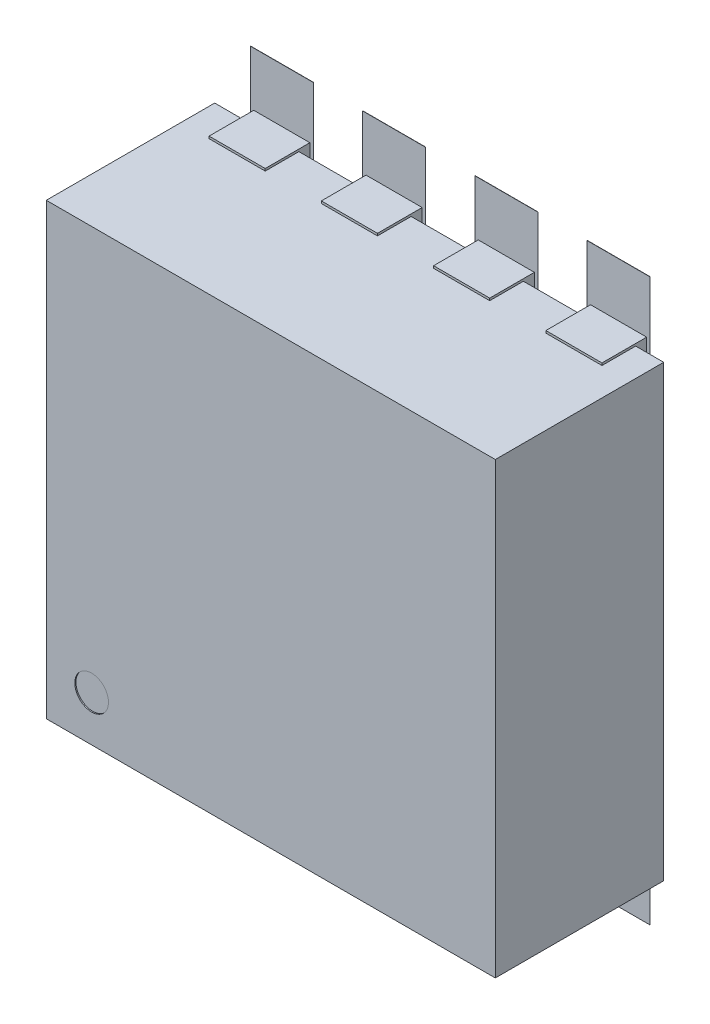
ISO-10303-21;
HEADER;
FILE_DESCRIPTION(('STEP AP214'),'2;1');
FILE_NAME('part.step','',(''),(''),'','','');
FILE_SCHEMA(('AUTOMOTIVE_DESIGN { 1 0 10303 214 1 1 1 1 }'));
ENDSEC;
DATA;
#1=APPLICATION_CONTEXT('core data for automotive mechanical design processes');
#2=APPLICATION_PROTOCOL_DEFINITION('international standard','automotive_design',2000,#1);
#3=PRODUCT_CONTEXT('',#1,'mechanical');
#4=PRODUCT('Part','Part','',(#3));
#5=PRODUCT_RELATED_PRODUCT_CATEGORY('part','',(#4));
#6=PRODUCT_DEFINITION_FORMATION('','',#4);
#7=PRODUCT_DEFINITION_CONTEXT('part definition',#1,'design');
#8=PRODUCT_DEFINITION('design','',#6,#7);
#9=PRODUCT_DEFINITION_SHAPE('','',#8);
#10=(LENGTH_UNIT() NAMED_UNIT(*) SI_UNIT(.MILLI.,.METRE.));
#11=(NAMED_UNIT(*) PLANE_ANGLE_UNIT() SI_UNIT($,.RADIAN.));
#12=(NAMED_UNIT(*) SI_UNIT($,.STERADIAN.) SOLID_ANGLE_UNIT());
#13=UNCERTAINTY_MEASURE_WITH_UNIT(LENGTH_MEASURE(1.E-05),#10,'distance_accuracy_value','');
#14=(GEOMETRIC_REPRESENTATION_CONTEXT(3) GLOBAL_UNCERTAINTY_ASSIGNED_CONTEXT((#13)) GLOBAL_UNIT_ASSIGNED_CONTEXT((#10,
#11,#12)) REPRESENTATION_CONTEXT('',''));
#15=CARTESIAN_POINT('',(0.,0.,0.));
#16=DIRECTION('',(0.,0.,1.));
#17=DIRECTION('',(1.,0.,0.));
#18=AXIS2_PLACEMENT_3D('',#15,#16,#17);
#19=CARTESIAN_POINT('',(0.,0.,0.0762));
#20=DIRECTION('',(0.,0.,1.));
#21=DIRECTION('',(1.,0.,0.));
#22=AXIS2_PLACEMENT_3D('',#19,#20,#21);
#23=PLANE('',#22);
#24=DIRECTION('',(1.,0.,0.));
#25=VECTOR('',#24,1.);
#26=CARTESIAN_POINT('',(0.6100064,0.3999992,0.0762));
#27=LINE('',#26,#25);
#28=CARTESIAN_POINT('',(0.6100064,0.3999992,0.0762));
#29=VERTEX_POINT('',#28);
#30=CARTESIAN_POINT('',(0.8899906,0.3999992,0.0762));
#31=VERTEX_POINT('',#30);
#32=EDGE_CURVE('E544',#29,#31,#27,.T.);
#33=ORIENTED_EDGE('',*,*,#32,.F.);
#34=DIRECTION('',(0.,1.,0.));
#35=VECTOR('',#34,1.);
#36=CARTESIAN_POINT('',(0.6100064,1.2500102,0.0762));
#37=LINE('',#36,#35);
#38=CARTESIAN_POINT('',(0.6100064,1.2500102,0.0762));
#39=VERTEX_POINT('',#38);
#40=EDGE_CURVE('E541',#39,#29,#37,.F.);
#41=ORIENTED_EDGE('',*,*,#40,.F.);
#42=DIRECTION('',(1.,0.,0.));
#43=VECTOR('',#42,1.);
#44=CARTESIAN_POINT('',(0.8899906,1.2500102,0.0762));
#45=LINE('',#44,#43);
#46=CARTESIAN_POINT('',(0.8899906,1.2500102,0.0762));
#47=VERTEX_POINT('',#46);
#48=EDGE_CURVE('E690',#47,#39,#45,.F.);
#49=ORIENTED_EDGE('',*,*,#48,.F.);
#50=DIRECTION('',(0.,1.,0.));
#51=VECTOR('',#50,1.);
#52=CARTESIAN_POINT('',(0.8899906,0.3999992,0.0762));
#53=LINE('',#52,#51);
#54=EDGE_CURVE('E567',#31,#47,#53,.T.);
#55=ORIENTED_EDGE('',*,*,#54,.F.);
#56=EDGE_LOOP('',(#33,#41,#49,#55));
#57=FACE_BOUND('',#56,.T.);
#58=ADVANCED_FACE('F16',(#57),#23,.F.);
#59=CARTESIAN_POINT('',(0.,0.,0.0762));
#60=DIRECTION('',(0.,0.,1.));
#61=DIRECTION('',(1.,0.,0.));
#62=AXIS2_PLACEMENT_3D('',#59,#60,#61);
#63=PLANE('',#62);
#64=DIRECTION('',(1.,0.,0.));
#65=VECTOR('',#64,1.);
#66=CARTESIAN_POINT('',(0.3899916,1.2500102,0.0762));
#67=LINE('',#66,#65);
#68=CARTESIAN_POINT('',(0.3899916,1.2500102,0.0762));
#69=VERTEX_POINT('',#68);
#70=CARTESIAN_POINT('',(0.1100074,1.2500102,0.0762));
#71=VERTEX_POINT('',#70);
#72=EDGE_CURVE('E682',#69,#71,#67,.F.);
#73=ORIENTED_EDGE('',*,*,#72,.F.);
#74=DIRECTION('',(0.,1.,0.));
#75=VECTOR('',#74,1.);
#76=CARTESIAN_POINT('',(0.3899916,0.3999992,0.0762));
#77=LINE('',#76,#75);
#78=CARTESIAN_POINT('',(0.3899916,0.3999992,0.0762));
#79=VERTEX_POINT('',#78);
#80=EDGE_CURVE('E686',#79,#69,#77,.T.);
#81=ORIENTED_EDGE('',*,*,#80,.F.);
#82=DIRECTION('',(1.,0.,0.));
#83=VECTOR('',#82,1.);
#84=CARTESIAN_POINT('',(0.1100074,0.3999992,0.0762));
#85=LINE('',#84,#83);
#86=CARTESIAN_POINT('',(0.1100074,0.3999992,0.0762));
#87=VERTEX_POINT('',#86);
#88=EDGE_CURVE('E674',#87,#79,#85,.T.);
#89=ORIENTED_EDGE('',*,*,#88,.F.);
#90=DIRECTION('',(0.,1.,0.));
#91=VECTOR('',#90,1.);
#92=CARTESIAN_POINT('',(0.1100074,1.2500102,0.0762));
#93=LINE('',#92,#91);
#94=EDGE_CURVE('E678',#71,#87,#93,.F.);
#95=ORIENTED_EDGE('',*,*,#94,.F.);
#96=EDGE_LOOP('',(#73,#81,#89,#95));
#97=FACE_BOUND('',#96,.T.);
#98=ADVANCED_FACE('F1623',(#97),#63,.F.);
#99=CARTESIAN_POINT('',(0.,0.,0.0762));
#100=DIRECTION('',(0.,0.,1.));
#101=DIRECTION('',(1.,0.,0.));
#102=AXIS2_PLACEMENT_3D('',#99,#100,#101);
#103=PLANE('',#102);
#104=DIRECTION('',(1.,0.,0.));
#105=VECTOR('',#104,1.);
#106=CARTESIAN_POINT('',(-0.1100074,1.2500102,0.0762));
#107=LINE('',#106,#105);
#108=CARTESIAN_POINT('',(-0.1100074,1.2500102,0.0762));
#109=VERTEX_POINT('',#108);
#110=CARTESIAN_POINT('',(-0.3899916,1.2500102,0.0762));
#111=VERTEX_POINT('',#110);
#112=EDGE_CURVE('E666',#109,#111,#107,.F.);
#113=ORIENTED_EDGE('',*,*,#112,.F.);
#114=DIRECTION('',(0.,1.,0.));
#115=VECTOR('',#114,1.);
#116=CARTESIAN_POINT('',(-0.1100074,0.3999992,0.0762));
#117=LINE('',#116,#115);
#118=CARTESIAN_POINT('',(-0.1100074,0.3999992,0.0762));
#119=VERTEX_POINT('',#118);
#120=EDGE_CURVE('E670',#119,#109,#117,.T.);
#121=ORIENTED_EDGE('',*,*,#120,.F.);
#122=DIRECTION('',(1.,0.,0.));
#123=VECTOR('',#122,1.);
#124=CARTESIAN_POINT('',(-0.3899916,0.3999992,0.0762));
#125=LINE('',#124,#123);
#126=CARTESIAN_POINT('',(-0.3899916,0.3999992,0.0762));
#127=VERTEX_POINT('',#126);
#128=EDGE_CURVE('E658',#127,#119,#125,.T.);
#129=ORIENTED_EDGE('',*,*,#128,.F.);
#130=DIRECTION('',(0.,1.,0.));
#131=VECTOR('',#130,1.);
#132=CARTESIAN_POINT('',(-0.3899916,1.2500102,0.0762));
#133=LINE('',#132,#131);
#134=EDGE_CURVE('E662',#111,#127,#133,.F.);
#135=ORIENTED_EDGE('',*,*,#134,.F.);
#136=EDGE_LOOP('',(#113,#121,#129,#135));
#137=FACE_BOUND('',#136,.T.);
#138=ADVANCED_FACE('F1620',(#137),#103,.F.);
#139=CARTESIAN_POINT('',(0.,0.,0.0762));
#140=DIRECTION('',(0.,0.,1.));
#141=DIRECTION('',(1.,0.,0.));
#142=AXIS2_PLACEMENT_3D('',#139,#140,#141);
#143=PLANE('',#142);
#144=DIRECTION('',(1.,0.,0.));
#145=VECTOR('',#144,1.);
#146=CARTESIAN_POINT('',(-0.6100064,1.2500102,0.0762));
#147=LINE('',#146,#145);
#148=CARTESIAN_POINT('',(-0.6100064,1.2500102,0.0762));
#149=VERTEX_POINT('',#148);
#150=CARTESIAN_POINT('',(-0.8899906,1.2500102,0.0762));
#151=VERTEX_POINT('',#150);
#152=EDGE_CURVE('E650',#149,#151,#147,.F.);
#153=ORIENTED_EDGE('',*,*,#152,.F.);
#154=DIRECTION('',(0.,1.,0.));
#155=VECTOR('',#154,1.);
#156=CARTESIAN_POINT('',(-0.6100064,0.3999992,0.0762));
#157=LINE('',#156,#155);
#158=CARTESIAN_POINT('',(-0.6100064,0.3999992,0.0762));
#159=VERTEX_POINT('',#158);
#160=EDGE_CURVE('E654',#159,#149,#157,.T.);
#161=ORIENTED_EDGE('',*,*,#160,.F.);
#162=DIRECTION('',(1.,0.,0.));
#163=VECTOR('',#162,1.);
#164=CARTESIAN_POINT('',(-0.8899906,0.3999992,0.0762));
#165=LINE('',#164,#163);
#166=CARTESIAN_POINT('',(-0.8899906,0.3999992,0.0762));
#167=VERTEX_POINT('',#166);
#168=EDGE_CURVE('E642',#167,#159,#165,.T.);
#169=ORIENTED_EDGE('',*,*,#168,.F.);
#170=DIRECTION('',(0.,1.,0.));
#171=VECTOR('',#170,1.);
#172=CARTESIAN_POINT('',(-0.8899906,1.2500102,0.0762));
#173=LINE('',#172,#171);
#174=EDGE_CURVE('E646',#151,#167,#173,.F.);
#175=ORIENTED_EDGE('',*,*,#174,.F.);
#176=EDGE_LOOP('',(#153,#161,#169,#175));
#177=FACE_BOUND('',#176,.T.);
#178=ADVANCED_FACE('F1616',(#177),#143,.F.);
#179=CARTESIAN_POINT('',(0.,0.,0.0762));
#180=DIRECTION('',(0.,0.,1.));
#181=DIRECTION('',(1.,0.,0.));
#182=AXIS2_PLACEMENT_3D('',#179,#180,#181);
#183=PLANE('',#182);
#184=DIRECTION('',(1.,0.,0.));
#185=VECTOR('',#184,1.);
#186=CARTESIAN_POINT('',(-0.3899916,-1.2500102,0.0762));
#187=LINE('',#186,#185);
#188=CARTESIAN_POINT('',(-0.3899916,-1.2500102,0.0762));
#189=VERTEX_POINT('',#188);
#190=CARTESIAN_POINT('',(-0.1100074,-1.2500102,0.0762));
#191=VERTEX_POINT('',#190);
#192=EDGE_CURVE('E634',#189,#191,#187,.T.);
#193=ORIENTED_EDGE('',*,*,#192,.F.);
#194=DIRECTION('',(0.,1.,0.));
#195=VECTOR('',#194,1.);
#196=CARTESIAN_POINT('',(-0.3899916,-0.3999992,0.0762));
#197=LINE('',#196,#195);
#198=CARTESIAN_POINT('',(-0.3899916,-0.3999992,0.0762));
#199=VERTEX_POINT('',#198);
#200=EDGE_CURVE('E638',#199,#189,#197,.F.);
#201=ORIENTED_EDGE('',*,*,#200,.F.);
#202=DIRECTION('',(1.,0.,0.));
#203=VECTOR('',#202,1.);
#204=CARTESIAN_POINT('',(-0.1100074,-0.3999992,0.0762));
#205=LINE('',#204,#203);
#206=CARTESIAN_POINT('',(-0.1100074,-0.3999992,0.0762));
#207=VERTEX_POINT('',#206);
#208=EDGE_CURVE('E626',#207,#199,#205,.F.);
#209=ORIENTED_EDGE('',*,*,#208,.F.);
#210=DIRECTION('',(0.,1.,0.));
#211=VECTOR('',#210,1.);
#212=CARTESIAN_POINT('',(-0.1100074,-1.2500102,0.0762));
#213=LINE('',#212,#211);
#214=EDGE_CURVE('E630',#191,#207,#213,.T.);
#215=ORIENTED_EDGE('',*,*,#214,.F.);
#216=EDGE_LOOP('',(#193,#201,#209,#215));
#217=FACE_BOUND('',#216,.T.);
#218=ADVANCED_FACE('F1612',(#217),#183,.F.);
#219=CARTESIAN_POINT('',(0.,0.,0.0762));
#220=DIRECTION('',(0.,0.,1.));
#221=DIRECTION('',(1.,0.,0.));
#222=AXIS2_PLACEMENT_3D('',#219,#220,#221);
#223=PLANE('',#222);
#224=DIRECTION('',(1.,0.,0.));
#225=VECTOR('',#224,1.);
#226=CARTESIAN_POINT('',(0.1100074,-1.2500102,0.0762));
#227=LINE('',#226,#225);
#228=CARTESIAN_POINT('',(0.1100074,-1.2500102,0.0762));
#229=VERTEX_POINT('',#228);
#230=CARTESIAN_POINT('',(0.3899916,-1.2500102,0.0762));
#231=VERTEX_POINT('',#230);
#232=EDGE_CURVE('E618',#229,#231,#227,.T.);
#233=ORIENTED_EDGE('',*,*,#232,.F.);
#234=DIRECTION('',(0.,1.,0.));
#235=VECTOR('',#234,1.);
#236=CARTESIAN_POINT('',(0.1100074,-0.3999992,0.0762));
#237=LINE('',#236,#235);
#238=CARTESIAN_POINT('',(0.1100074,-0.3999992,0.0762));
#239=VERTEX_POINT('',#238);
#240=EDGE_CURVE('E622',#239,#229,#237,.F.);
#241=ORIENTED_EDGE('',*,*,#240,.F.);
#242=DIRECTION('',(1.,0.,0.));
#243=VECTOR('',#242,1.);
#244=CARTESIAN_POINT('',(0.3899916,-0.3999992,0.0762));
#245=LINE('',#244,#243);
#246=CARTESIAN_POINT('',(0.3899916,-0.3999992,0.0762));
#247=VERTEX_POINT('',#246);
#248=EDGE_CURVE('E610',#247,#239,#245,.F.);
#249=ORIENTED_EDGE('',*,*,#248,.F.);
#250=DIRECTION('',(0.,1.,0.));
#251=VECTOR('',#250,1.);
#252=CARTESIAN_POINT('',(0.3899916,-1.2500102,0.0762));
#253=LINE('',#252,#251);
#254=EDGE_CURVE('E614',#231,#247,#253,.T.);
#255=ORIENTED_EDGE('',*,*,#254,.F.);
#256=EDGE_LOOP('',(#233,#241,#249,#255));
#257=FACE_BOUND('',#256,.T.);
#258=ADVANCED_FACE('F1608',(#257),#223,.F.);
#259=CARTESIAN_POINT('',(0.,0.,0.0762));
#260=DIRECTION('',(0.,0.,1.));
#261=DIRECTION('',(1.,0.,0.));
#262=AXIS2_PLACEMENT_3D('',#259,#260,#261);
#263=PLANE('',#262);
#264=DIRECTION('',(1.,0.,0.));
#265=VECTOR('',#264,1.);
#266=CARTESIAN_POINT('',(0.6100064,-1.2500102,0.0762));
#267=LINE('',#266,#265);
#268=CARTESIAN_POINT('',(0.6100064,-1.2500102,0.0762));
#269=VERTEX_POINT('',#268);
#270=CARTESIAN_POINT('',(0.8899906,-1.2500102,0.0762));
#271=VERTEX_POINT('',#270);
#272=EDGE_CURVE('E602',#269,#271,#267,.T.);
#273=ORIENTED_EDGE('',*,*,#272,.F.);
#274=DIRECTION('',(0.,1.,0.));
#275=VECTOR('',#274,1.);
#276=CARTESIAN_POINT('',(0.6100064,-0.3999992,0.0762));
#277=LINE('',#276,#275);
#278=CARTESIAN_POINT('',(0.6100064,-0.3999992,0.0762));
#279=VERTEX_POINT('',#278);
#280=EDGE_CURVE('E606',#279,#269,#277,.F.);
#281=ORIENTED_EDGE('',*,*,#280,.F.);
#282=DIRECTION('',(1.,0.,0.));
#283=VECTOR('',#282,1.);
#284=CARTESIAN_POINT('',(0.8899906,-0.3999992,0.0762));
#285=LINE('',#284,#283);
#286=CARTESIAN_POINT('',(0.8899906,-0.3999992,0.0762));
#287=VERTEX_POINT('',#286);
#288=EDGE_CURVE('E594',#287,#279,#285,.F.);
#289=ORIENTED_EDGE('',*,*,#288,.F.);
#290=DIRECTION('',(0.,1.,0.));
#291=VECTOR('',#290,1.);
#292=CARTESIAN_POINT('',(0.8899906,-1.2500102,0.0762));
#293=LINE('',#292,#291);
#294=EDGE_CURVE('E598',#271,#287,#293,.T.);
#295=ORIENTED_EDGE('',*,*,#294,.F.);
#296=EDGE_LOOP('',(#273,#281,#289,#295));
#297=FACE_BOUND('',#296,.T.);
#298=ADVANCED_FACE('F1604',(#297),#263,.F.);
#299=CARTESIAN_POINT('',(0.,0.,0.0762));
#300=DIRECTION('',(0.,0.,1.));
#301=DIRECTION('',(1.,0.,0.));
#302=AXIS2_PLACEMENT_3D('',#299,#300,#301);
#303=PLANE('',#302);
#304=DIRECTION('',(1.,0.,0.));
#305=VECTOR('',#304,1.);
#306=CARTESIAN_POINT('',(-0.8899906,-1.2500102,0.0762));
#307=LINE('',#306,#305);
#308=CARTESIAN_POINT('',(-0.8899906,-1.2500102,0.0762));
#309=VERTEX_POINT('',#308);
#310=CARTESIAN_POINT('',(-0.6100064,-1.2500102,0.0762));
#311=VERTEX_POINT('',#310);
#312=EDGE_CURVE('E586',#309,#311,#307,.T.);
#313=ORIENTED_EDGE('',*,*,#312,.F.);
#314=DIRECTION('',(0.,1.,0.));
#315=VECTOR('',#314,1.);
#316=CARTESIAN_POINT('',(-0.8899906,-0.2999994,0.0762));
#317=LINE('',#316,#315);
#318=CARTESIAN_POINT('',(-0.8899906,-0.2999994,0.0762));
#319=VERTEX_POINT('',#318);
#320=EDGE_CURVE('E590',#319,#309,#317,.F.);
#321=ORIENTED_EDGE('',*,*,#320,.F.);
#322=DIRECTION('',(1.,0.,0.));
#323=VECTOR('',#322,1.);
#324=CARTESIAN_POINT('',(-0.6100064,-0.2999994,0.0762));
#325=LINE('',#324,#323);
#326=CARTESIAN_POINT('',(-0.6100064,-0.2999994,0.0762));
#327=VERTEX_POINT('',#326);
#328=EDGE_CURVE('E559',#327,#319,#325,.F.);
#329=ORIENTED_EDGE('',*,*,#328,.F.);
#330=DIRECTION('',(0.,1.,0.));
#331=VECTOR('',#330,1.);
#332=CARTESIAN_POINT('',(-0.6100064,-1.2500102,0.0762));
#333=LINE('',#332,#331);
#334=EDGE_CURVE('E582',#311,#327,#333,.T.);
#335=ORIENTED_EDGE('',*,*,#334,.F.);
#336=EDGE_LOOP('',(#313,#321,#329,#335));
#337=FACE_BOUND('',#336,.T.);
#338=ADVANCED_FACE('F1601',(#337),#303,.F.);
#339=CARTESIAN_POINT('',(0.6100064,1.2500102,0.0762));
#340=DIRECTION('',(-1.,0.,0.));
#341=DIRECTION('',(0.,0.,1.));
#342=AXIS2_PLACEMENT_3D('',#339,#340,#341);
#343=PLANE('',#342);
#344=DIRECTION('',(0.,0.,1.));
#345=VECTOR('',#344,1.);
#346=CARTESIAN_POINT('',(0.6100064,1.2500102,0.0762));
#347=LINE('',#346,#345);
#348=CARTESIAN_POINT('',(0.6100064,1.2500102,0.077199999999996));
#349=VERTEX_POINT('',#348);
#350=EDGE_CURVE('E568',#39,#349,#347,.T.);
#351=ORIENTED_EDGE('',*,*,#350,.F.);
#352=ORIENTED_EDGE('',*,*,#40,.T.);
#353=DIRECTION('',(0.,0.,-1.));
#354=VECTOR('',#353,1.);
#355=CARTESIAN_POINT('',(0.6100064,0.3999992,0.0762));
#356=LINE('',#355,#354);
#357=CARTESIAN_POINT('',(0.6100064,0.3999992,0.077199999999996));
#358=VERTEX_POINT('',#357);
#359=EDGE_CURVE('E19',#358,#29,#356,.T.);
#360=ORIENTED_EDGE('',*,*,#359,.F.);
#361=DIRECTION('',(0.,1.,0.));
#362=VECTOR('',#361,1.);
#363=CARTESIAN_POINT('',(0.6100064,0.,0.077199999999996));
#364=LINE('',#363,#362);
#365=EDGE_CURVE('E539',#349,#358,#364,.F.);
#366=ORIENTED_EDGE('',*,*,#365,.F.);
#367=EDGE_LOOP('',(#351,#352,#360,#366));
#368=FACE_BOUND('',#367,.T.);
#369=ADVANCED_FACE('F537',(#368),#343,.T.);
#370=CARTESIAN_POINT('',(0.6100064,0.3999992,0.0762));
#371=DIRECTION('',(0.,-1.,0.));
#372=DIRECTION('',(0.,0.,-1.));
#373=AXIS2_PLACEMENT_3D('',#370,#371,#372);
#374=PLANE('',#373);
#375=ORIENTED_EDGE('',*,*,#359,.T.);
#376=ORIENTED_EDGE('',*,*,#32,.T.);
#377=DIRECTION('',(0.,0.,-1.));
#378=VECTOR('',#377,1.);
#379=CARTESIAN_POINT('',(0.8899906,0.3999992,0.0762));
#380=LINE('',#379,#378);
#381=CARTESIAN_POINT('',(0.8899906,0.3999992,0.077199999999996));
#382=VERTEX_POINT('',#381);
#383=EDGE_CURVE('E549',#382,#31,#380,.T.);
#384=ORIENTED_EDGE('',*,*,#383,.F.);
#385=DIRECTION('',(1.,0.,0.));
#386=VECTOR('',#385,1.);
#387=CARTESIAN_POINT('',(0.,0.3999992,0.077199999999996));
#388=LINE('',#387,#386);
#389=EDGE_CURVE('E546',#358,#382,#388,.T.);
#390=ORIENTED_EDGE('',*,*,#389,.F.);
#391=EDGE_LOOP('',(#375,#376,#384,#390));
#392=FACE_BOUND('',#391,.T.);
#393=ADVANCED_FACE('F547',(#392),#374,.T.);
#394=CARTESIAN_POINT('',(0.8899906,0.3999992,0.0762));
#395=DIRECTION('',(1.,0.,0.));
#396=DIRECTION('',(0.,0.,-1.));
#397=AXIS2_PLACEMENT_3D('',#394,#395,#396);
#398=PLANE('',#397);
#399=ORIENTED_EDGE('',*,*,#383,.T.);
#400=ORIENTED_EDGE('',*,*,#54,.T.);
#401=DIRECTION('',(0.,0.,1.));
#402=VECTOR('',#401,1.);
#403=CARTESIAN_POINT('',(0.8899906,1.2500102,0.0762));
#404=LINE('',#403,#402);
#405=CARTESIAN_POINT('',(0.8899906,1.2500102,0.077199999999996));
#406=VERTEX_POINT('',#405);
#407=EDGE_CURVE('E687',#406,#47,#404,.F.);
#408=ORIENTED_EDGE('',*,*,#407,.F.);
#409=DIRECTION('',(0.,1.,0.));
#410=VECTOR('',#409,1.);
#411=CARTESIAN_POINT('',(0.8899906,0.,0.077199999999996));
#412=LINE('',#411,#410);
#413=EDGE_CURVE('E553',#382,#406,#412,.T.);
#414=ORIENTED_EDGE('',*,*,#413,.F.);
#415=EDGE_LOOP('',(#399,#400,#408,#414));
#416=FACE_BOUND('',#415,.T.);
#417=ADVANCED_FACE('F692',(#416),#398,.T.);
#418=CARTESIAN_POINT('',(0.8899906,1.2500102,0.0762));
#419=DIRECTION('',(0.,1.,0.));
#420=DIRECTION('',(0.,0.,1.));
#421=AXIS2_PLACEMENT_3D('',#418,#419,#420);
#422=PLANE('',#421);
#423=ORIENTED_EDGE('',*,*,#407,.T.);
#424=ORIENTED_EDGE('',*,*,#48,.T.);
#425=ORIENTED_EDGE('',*,*,#350,.T.);
#426=DIRECTION('',(1.,0.,0.));
#427=VECTOR('',#426,1.);
#428=CARTESIAN_POINT('',(0.,1.2500102,0.077199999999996));
#429=LINE('',#428,#427);
#430=EDGE_CURVE('E558',#406,#349,#429,.F.);
#431=ORIENTED_EDGE('',*,*,#430,.F.);
#432=EDGE_LOOP('',(#423,#424,#425,#431));
#433=FACE_BOUND('',#432,.T.);
#434=ADVANCED_FACE('F1590',(#433),#422,.T.);
#435=CARTESIAN_POINT('',(0.3899916,0.3999992,0.0762));
#436=DIRECTION('',(1.,0.,0.));
#437=DIRECTION('',(0.,0.,-1.));
#438=AXIS2_PLACEMENT_3D('',#435,#436,#437);
#439=PLANE('',#438);
#440=DIRECTION('',(0.,0.,-1.));
#441=VECTOR('',#440,1.);
#442=CARTESIAN_POINT('',(0.3899916,0.3999992,0.0762));
#443=LINE('',#442,#441);
#444=CARTESIAN_POINT('',(0.3899916,0.3999992,0.077199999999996));
#445=VERTEX_POINT('',#444);
#446=EDGE_CURVE('E675',#79,#445,#443,.F.);
#447=ORIENTED_EDGE('',*,*,#446,.F.);
#448=ORIENTED_EDGE('',*,*,#80,.T.);
#449=DIRECTION('',(0.,0.,1.));
#450=VECTOR('',#449,1.);
#451=CARTESIAN_POINT('',(0.3899916,1.2500102,0.0762));
#452=LINE('',#451,#450);
#453=CARTESIAN_POINT('',(0.3899916,1.2500102,0.077199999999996));
#454=VERTEX_POINT('',#453);
#455=EDGE_CURVE('E683',#454,#69,#452,.F.);
#456=ORIENTED_EDGE('',*,*,#455,.F.);
#457=DIRECTION('',(0.,1.,0.));
#458=VECTOR('',#457,1.);
#459=CARTESIAN_POINT('',(0.3899916,0.,0.077199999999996));
#460=LINE('',#459,#458);
#461=EDGE_CURVE('E705',#445,#454,#460,.T.);
#462=ORIENTED_EDGE('',*,*,#461,.F.);
#463=EDGE_LOOP('',(#447,#448,#456,#462));
#464=FACE_BOUND('',#463,.T.);
#465=ADVANCED_FACE('F1586',(#464),#439,.T.);
#466=CARTESIAN_POINT('',(0.3899916,1.2500102,0.0762));
#467=DIRECTION('',(0.,1.,0.));
#468=DIRECTION('',(0.,0.,1.));
#469=AXIS2_PLACEMENT_3D('',#466,#467,#468);
#470=PLANE('',#469);
#471=ORIENTED_EDGE('',*,*,#455,.T.);
#472=ORIENTED_EDGE('',*,*,#72,.T.);
#473=DIRECTION('',(0.,0.,1.));
#474=VECTOR('',#473,1.);
#475=CARTESIAN_POINT('',(0.1100074,1.2500102,0.0762));
#476=LINE('',#475,#474);
#477=CARTESIAN_POINT('',(0.1100074,1.2500102,0.077199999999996));
#478=VERTEX_POINT('',#477);
#479=EDGE_CURVE('E679',#478,#71,#476,.F.);
#480=ORIENTED_EDGE('',*,*,#479,.F.);
#481=DIRECTION('',(1.,0.,0.));
#482=VECTOR('',#481,1.);
#483=CARTESIAN_POINT('',(0.,1.2500102,0.077199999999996));
#484=LINE('',#483,#482);
#485=EDGE_CURVE('E701',#454,#478,#484,.F.);
#486=ORIENTED_EDGE('',*,*,#485,.F.);
#487=EDGE_LOOP('',(#471,#472,#480,#486));
#488=FACE_BOUND('',#487,.T.);
#489=ADVANCED_FACE('F1582',(#488),#470,.T.);
#490=CARTESIAN_POINT('',(0.1100074,1.2500102,0.0762));
#491=DIRECTION('',(-1.,0.,0.));
#492=DIRECTION('',(0.,0.,1.));
#493=AXIS2_PLACEMENT_3D('',#490,#491,#492);
#494=PLANE('',#493);
#495=ORIENTED_EDGE('',*,*,#479,.T.);
#496=ORIENTED_EDGE('',*,*,#94,.T.);
#497=DIRECTION('',(0.,0.,-1.));
#498=VECTOR('',#497,1.);
#499=CARTESIAN_POINT('',(0.1100074,0.3999992,0.0762));
#500=LINE('',#499,#498);
#501=CARTESIAN_POINT('',(0.1100074,0.3999992,0.077199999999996));
#502=VERTEX_POINT('',#501);
#503=EDGE_CURVE('E671',#502,#87,#500,.T.);
#504=ORIENTED_EDGE('',*,*,#503,.F.);
#505=DIRECTION('',(0.,1.,0.));
#506=VECTOR('',#505,1.);
#507=CARTESIAN_POINT('',(0.1100074,0.,0.077199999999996));
#508=LINE('',#507,#506);
#509=EDGE_CURVE('E704',#478,#502,#508,.F.);
#510=ORIENTED_EDGE('',*,*,#509,.F.);
#511=EDGE_LOOP('',(#495,#496,#504,#510));
#512=FACE_BOUND('',#511,.T.);
#513=ADVANCED_FACE('F1578',(#512),#494,.T.);
#514=CARTESIAN_POINT('',(0.1100074,0.3999992,0.0762));
#515=DIRECTION('',(0.,-1.,0.));
#516=DIRECTION('',(0.,0.,-1.));
#517=AXIS2_PLACEMENT_3D('',#514,#515,#516);
#518=PLANE('',#517);
#519=ORIENTED_EDGE('',*,*,#503,.T.);
#520=ORIENTED_EDGE('',*,*,#88,.T.);
#521=ORIENTED_EDGE('',*,*,#446,.T.);
#522=DIRECTION('',(1.,0.,0.));
#523=VECTOR('',#522,1.);
#524=CARTESIAN_POINT('',(0.,0.3999992,0.077199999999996));
#525=LINE('',#524,#523);
#526=EDGE_CURVE('E709',#502,#445,#525,.T.);
#527=ORIENTED_EDGE('',*,*,#526,.F.);
#528=EDGE_LOOP('',(#519,#520,#521,#527));
#529=FACE_BOUND('',#528,.T.);
#530=ADVANCED_FACE('F1574',(#529),#518,.T.);
#531=CARTESIAN_POINT('',(-0.1100074,0.3999992,0.0762));
#532=DIRECTION('',(1.,0.,0.));
#533=DIRECTION('',(0.,0.,-1.));
#534=AXIS2_PLACEMENT_3D('',#531,#532,#533);
#535=PLANE('',#534);
#536=DIRECTION('',(0.,0.,-1.));
#537=VECTOR('',#536,1.);
#538=CARTESIAN_POINT('',(-0.1100074,0.3999992,0.0762));
#539=LINE('',#538,#537);
#540=CARTESIAN_POINT('',(-0.1100074,0.3999992,0.077199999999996));
#541=VERTEX_POINT('',#540);
#542=EDGE_CURVE('E659',#119,#541,#539,.F.);
#543=ORIENTED_EDGE('',*,*,#542,.F.);
#544=ORIENTED_EDGE('',*,*,#120,.T.);
#545=DIRECTION('',(0.,0.,1.));
#546=VECTOR('',#545,1.);
#547=CARTESIAN_POINT('',(-0.1100074,1.2500102,0.0762));
#548=LINE('',#547,#546);
#549=CARTESIAN_POINT('',(-0.1100074,1.2500102,0.077199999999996));
#550=VERTEX_POINT('',#549);
#551=EDGE_CURVE('E667',#550,#109,#548,.F.);
#552=ORIENTED_EDGE('',*,*,#551,.F.);
#553=DIRECTION('',(0.,1.,0.));
#554=VECTOR('',#553,1.);
#555=CARTESIAN_POINT('',(-0.1100074,0.,0.077199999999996));
#556=LINE('',#555,#554);
#557=EDGE_CURVE('E723',#541,#550,#556,.T.);
#558=ORIENTED_EDGE('',*,*,#557,.F.);
#559=EDGE_LOOP('',(#543,#544,#552,#558));
#560=FACE_BOUND('',#559,.T.);
#561=ADVANCED_FACE('F1570',(#560),#535,.T.);
#562=CARTESIAN_POINT('',(-0.1100074,1.2500102,0.0762));
#563=DIRECTION('',(0.,1.,0.));
#564=DIRECTION('',(0.,0.,1.));
#565=AXIS2_PLACEMENT_3D('',#562,#563,#564);
#566=PLANE('',#565);
#567=ORIENTED_EDGE('',*,*,#551,.T.);
#568=ORIENTED_EDGE('',*,*,#112,.T.);
#569=DIRECTION('',(0.,0.,1.));
#570=VECTOR('',#569,1.);
#571=CARTESIAN_POINT('',(-0.3899916,1.2500102,0.0762));
#572=LINE('',#571,#570);
#573=CARTESIAN_POINT('',(-0.3899916,1.2500102,0.077199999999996));
#574=VERTEX_POINT('',#573);
#575=EDGE_CURVE('E663',#574,#111,#572,.F.);
#576=ORIENTED_EDGE('',*,*,#575,.F.);
#577=DIRECTION('',(1.,0.,0.));
#578=VECTOR('',#577,1.);
#579=CARTESIAN_POINT('',(0.,1.2500102,0.077199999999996));
#580=LINE('',#579,#578);
#581=EDGE_CURVE('E719',#550,#574,#580,.F.);
#582=ORIENTED_EDGE('',*,*,#581,.F.);
#583=EDGE_LOOP('',(#567,#568,#576,#582));
#584=FACE_BOUND('',#583,.T.);
#585=ADVANCED_FACE('F1566',(#584),#566,.T.);
#586=CARTESIAN_POINT('',(-0.3899916,1.2500102,0.0762));
#587=DIRECTION('',(-1.,0.,0.));
#588=DIRECTION('',(0.,0.,1.));
#589=AXIS2_PLACEMENT_3D('',#586,#587,#588);
#590=PLANE('',#589);
#591=ORIENTED_EDGE('',*,*,#575,.T.);
#592=ORIENTED_EDGE('',*,*,#134,.T.);
#593=DIRECTION('',(0.,0.,-1.));
#594=VECTOR('',#593,1.);
#595=CARTESIAN_POINT('',(-0.3899916,0.3999992,0.0762));
#596=LINE('',#595,#594);
#597=CARTESIAN_POINT('',(-0.3899916,0.3999992,0.077199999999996));
#598=VERTEX_POINT('',#597);
#599=EDGE_CURVE('E655',#598,#127,#596,.T.);
#600=ORIENTED_EDGE('',*,*,#599,.F.);
#601=DIRECTION('',(0.,1.,0.));
#602=VECTOR('',#601,1.);
#603=CARTESIAN_POINT('',(-0.3899916,0.,0.077199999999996));
#604=LINE('',#603,#602);
#605=EDGE_CURVE('E722',#574,#598,#604,.F.);
#606=ORIENTED_EDGE('',*,*,#605,.F.);
#607=EDGE_LOOP('',(#591,#592,#600,#606));
#608=FACE_BOUND('',#607,.T.);
#609=ADVANCED_FACE('F1562',(#608),#590,.T.);
#610=CARTESIAN_POINT('',(-0.3899916,0.3999992,0.0762));
#611=DIRECTION('',(0.,-1.,0.));
#612=DIRECTION('',(0.,0.,-1.));
#613=AXIS2_PLACEMENT_3D('',#610,#611,#612);
#614=PLANE('',#613);
#615=ORIENTED_EDGE('',*,*,#599,.T.);
#616=ORIENTED_EDGE('',*,*,#128,.T.);
#617=ORIENTED_EDGE('',*,*,#542,.T.);
#618=DIRECTION('',(1.,0.,0.));
#619=VECTOR('',#618,1.);
#620=CARTESIAN_POINT('',(0.,0.3999992,0.077199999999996));
#621=LINE('',#620,#619);
#622=EDGE_CURVE('E727',#598,#541,#621,.T.);
#623=ORIENTED_EDGE('',*,*,#622,.F.);
#624=EDGE_LOOP('',(#615,#616,#617,#623));
#625=FACE_BOUND('',#624,.T.);
#626=ADVANCED_FACE('F1558',(#625),#614,.T.);
#627=CARTESIAN_POINT('',(-0.6100064,0.3999992,0.0762));
#628=DIRECTION('',(1.,0.,0.));
#629=DIRECTION('',(0.,0.,-1.));
#630=AXIS2_PLACEMENT_3D('',#627,#628,#629);
#631=PLANE('',#630);
#632=DIRECTION('',(0.,0.,-1.));
#633=VECTOR('',#632,1.);
#634=CARTESIAN_POINT('',(-0.6100064,0.3999992,0.0762));
#635=LINE('',#634,#633);
#636=CARTESIAN_POINT('',(-0.6100064,0.3999992,0.077199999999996));
#637=VERTEX_POINT('',#636);
#638=EDGE_CURVE('E643',#159,#637,#635,.F.);
#639=ORIENTED_EDGE('',*,*,#638,.F.);
#640=ORIENTED_EDGE('',*,*,#160,.T.);
#641=DIRECTION('',(0.,0.,1.));
#642=VECTOR('',#641,1.);
#643=CARTESIAN_POINT('',(-0.6100064,1.2500102,0.0762));
#644=LINE('',#643,#642);
#645=CARTESIAN_POINT('',(-0.6100064,1.2500102,0.077199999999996));
#646=VERTEX_POINT('',#645);
#647=EDGE_CURVE('E651',#646,#149,#644,.F.);
#648=ORIENTED_EDGE('',*,*,#647,.F.);
#649=DIRECTION('',(0.,1.,0.));
#650=VECTOR('',#649,1.);
#651=CARTESIAN_POINT('',(-0.6100064,0.,0.077199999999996));
#652=LINE('',#651,#650);
#653=EDGE_CURVE('E741',#637,#646,#652,.T.);
#654=ORIENTED_EDGE('',*,*,#653,.F.);
#655=EDGE_LOOP('',(#639,#640,#648,#654));
#656=FACE_BOUND('',#655,.T.);
#657=ADVANCED_FACE('F1554',(#656),#631,.T.);
#658=CARTESIAN_POINT('',(-0.6100064,1.2500102,0.0762));
#659=DIRECTION('',(0.,1.,0.));
#660=DIRECTION('',(0.,0.,1.));
#661=AXIS2_PLACEMENT_3D('',#658,#659,#660);
#662=PLANE('',#661);
#663=ORIENTED_EDGE('',*,*,#647,.T.);
#664=ORIENTED_EDGE('',*,*,#152,.T.);
#665=DIRECTION('',(0.,0.,1.));
#666=VECTOR('',#665,1.);
#667=CARTESIAN_POINT('',(-0.8899906,1.2500102,0.0762));
#668=LINE('',#667,#666);
#669=CARTESIAN_POINT('',(-0.8899906,1.2500102,0.077199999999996));
#670=VERTEX_POINT('',#669);
#671=EDGE_CURVE('E647',#670,#151,#668,.F.);
#672=ORIENTED_EDGE('',*,*,#671,.F.);
#673=DIRECTION('',(1.,0.,0.));
#674=VECTOR('',#673,1.);
#675=CARTESIAN_POINT('',(0.,1.2500102,0.077199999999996));
#676=LINE('',#675,#674);
#677=EDGE_CURVE('E737',#646,#670,#676,.F.);
#678=ORIENTED_EDGE('',*,*,#677,.F.);
#679=EDGE_LOOP('',(#663,#664,#672,#678));
#680=FACE_BOUND('',#679,.T.);
#681=ADVANCED_FACE('F1550',(#680),#662,.T.);
#682=CARTESIAN_POINT('',(-0.8899906,1.2500102,0.0762));
#683=DIRECTION('',(-1.,0.,0.));
#684=DIRECTION('',(0.,0.,1.));
#685=AXIS2_PLACEMENT_3D('',#682,#683,#684);
#686=PLANE('',#685);
#687=ORIENTED_EDGE('',*,*,#671,.T.);
#688=ORIENTED_EDGE('',*,*,#174,.T.);
#689=DIRECTION('',(0.,0.,-1.));
#690=VECTOR('',#689,1.);
#691=CARTESIAN_POINT('',(-0.8899906,0.3999992,0.0762));
#692=LINE('',#691,#690);
#693=CARTESIAN_POINT('',(-0.8899906,0.3999992,0.077199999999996));
#694=VERTEX_POINT('',#693);
#695=EDGE_CURVE('E639',#694,#167,#692,.T.);
#696=ORIENTED_EDGE('',*,*,#695,.F.);
#697=DIRECTION('',(0.,1.,0.));
#698=VECTOR('',#697,1.);
#699=CARTESIAN_POINT('',(-0.8899906,0.,0.077199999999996));
#700=LINE('',#699,#698);
#701=EDGE_CURVE('E740',#670,#694,#700,.F.);
#702=ORIENTED_EDGE('',*,*,#701,.F.);
#703=EDGE_LOOP('',(#687,#688,#696,#702));
#704=FACE_BOUND('',#703,.T.);
#705=ADVANCED_FACE('F1546',(#704),#686,.T.);
#706=CARTESIAN_POINT('',(-0.8899906,0.3999992,0.0762));
#707=DIRECTION('',(0.,-1.,0.));
#708=DIRECTION('',(0.,0.,-1.));
#709=AXIS2_PLACEMENT_3D('',#706,#707,#708);
#710=PLANE('',#709);
#711=ORIENTED_EDGE('',*,*,#695,.T.);
#712=ORIENTED_EDGE('',*,*,#168,.T.);
#713=ORIENTED_EDGE('',*,*,#638,.T.);
#714=DIRECTION('',(1.,0.,0.));
#715=VECTOR('',#714,1.);
#716=CARTESIAN_POINT('',(0.,0.3999992,0.077199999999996));
#717=LINE('',#716,#715);
#718=EDGE_CURVE('E745',#694,#637,#717,.T.);
#719=ORIENTED_EDGE('',*,*,#718,.F.);
#720=EDGE_LOOP('',(#711,#712,#713,#719));
#721=FACE_BOUND('',#720,.T.);
#722=ADVANCED_FACE('F1542',(#721),#710,.T.);
#723=CARTESIAN_POINT('',(-0.3899916,-0.3999992,0.0762));
#724=DIRECTION('',(-1.,0.,0.));
#725=DIRECTION('',(0.,0.,1.));
#726=AXIS2_PLACEMENT_3D('',#723,#724,#725);
#727=PLANE('',#726);
#728=DIRECTION('',(0.,0.,1.));
#729=VECTOR('',#728,1.);
#730=CARTESIAN_POINT('',(-0.3899916,-0.3999992,0.0762));
#731=LINE('',#730,#729);
#732=CARTESIAN_POINT('',(-0.3899916,-0.3999992,0.077199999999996));
#733=VERTEX_POINT('',#732);
#734=EDGE_CURVE('E627',#199,#733,#731,.T.);
#735=ORIENTED_EDGE('',*,*,#734,.F.);
#736=ORIENTED_EDGE('',*,*,#200,.T.);
#737=DIRECTION('',(0.,0.,-1.));
#738=VECTOR('',#737,1.);
#739=CARTESIAN_POINT('',(-0.3899916,-1.2500102,0.0762));
#740=LINE('',#739,#738);
#741=CARTESIAN_POINT('',(-0.3899916,-1.2500102,0.077199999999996));
#742=VERTEX_POINT('',#741);
#743=EDGE_CURVE('E635',#742,#189,#740,.T.);
#744=ORIENTED_EDGE('',*,*,#743,.F.);
#745=DIRECTION('',(0.,1.,0.));
#746=VECTOR('',#745,1.);
#747=CARTESIAN_POINT('',(-0.3899916,0.,0.077199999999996));
#748=LINE('',#747,#746);
#749=EDGE_CURVE('E759',#733,#742,#748,.F.);
#750=ORIENTED_EDGE('',*,*,#749,.F.);
#751=EDGE_LOOP('',(#735,#736,#744,#750));
#752=FACE_BOUND('',#751,.T.);
#753=ADVANCED_FACE('F1538',(#752),#727,.T.);
#754=CARTESIAN_POINT('',(-0.3899916,-1.2500102,0.0762));
#755=DIRECTION('',(0.,-1.,0.));
#756=DIRECTION('',(0.,0.,-1.));
#757=AXIS2_PLACEMENT_3D('',#754,#755,#756);
#758=PLANE('',#757);
#759=ORIENTED_EDGE('',*,*,#743,.T.);
#760=ORIENTED_EDGE('',*,*,#192,.T.);
#761=DIRECTION('',(0.,0.,-1.));
#762=VECTOR('',#761,1.);
#763=CARTESIAN_POINT('',(-0.1100074,-1.2500102,0.0762));
#764=LINE('',#763,#762);
#765=CARTESIAN_POINT('',(-0.1100074,-1.2500102,0.077199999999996));
#766=VERTEX_POINT('',#765);
#767=EDGE_CURVE('E631',#766,#191,#764,.T.);
#768=ORIENTED_EDGE('',*,*,#767,.F.);
#769=DIRECTION('',(1.,0.,0.));
#770=VECTOR('',#769,1.);
#771=CARTESIAN_POINT('',(0.,-1.2500102,0.077199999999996));
#772=LINE('',#771,#770);
#773=EDGE_CURVE('E755',#742,#766,#772,.T.);
#774=ORIENTED_EDGE('',*,*,#773,.F.);
#775=EDGE_LOOP('',(#759,#760,#768,#774));
#776=FACE_BOUND('',#775,.T.);
#777=ADVANCED_FACE('F1534',(#776),#758,.T.);
#778=CARTESIAN_POINT('',(-0.1100074,-1.2500102,0.0762));
#779=DIRECTION('',(1.,0.,0.));
#780=DIRECTION('',(0.,0.,-1.));
#781=AXIS2_PLACEMENT_3D('',#778,#779,#780);
#782=PLANE('',#781);
#783=ORIENTED_EDGE('',*,*,#767,.T.);
#784=ORIENTED_EDGE('',*,*,#214,.T.);
#785=DIRECTION('',(0.,0.,1.));
#786=VECTOR('',#785,1.);
#787=CARTESIAN_POINT('',(-0.1100074,-0.3999992,0.0762));
#788=LINE('',#787,#786);
#789=CARTESIAN_POINT('',(-0.1100074,-0.3999992,0.077199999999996));
#790=VERTEX_POINT('',#789);
#791=EDGE_CURVE('E623',#790,#207,#788,.F.);
#792=ORIENTED_EDGE('',*,*,#791,.F.);
#793=DIRECTION('',(0.,1.,0.));
#794=VECTOR('',#793,1.);
#795=CARTESIAN_POINT('',(-0.1100074,0.,0.077199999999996));
#796=LINE('',#795,#794);
#797=EDGE_CURVE('E758',#766,#790,#796,.T.);
#798=ORIENTED_EDGE('',*,*,#797,.F.);
#799=EDGE_LOOP('',(#783,#784,#792,#798));
#800=FACE_BOUND('',#799,.T.);
#801=ADVANCED_FACE('F1530',(#800),#782,.T.);
#802=CARTESIAN_POINT('',(-0.1100074,-0.3999992,0.0762));
#803=DIRECTION('',(0.,1.,0.));
#804=DIRECTION('',(0.,0.,1.));
#805=AXIS2_PLACEMENT_3D('',#802,#803,#804);
#806=PLANE('',#805);
#807=ORIENTED_EDGE('',*,*,#791,.T.);
#808=ORIENTED_EDGE('',*,*,#208,.T.);
#809=ORIENTED_EDGE('',*,*,#734,.T.);
#810=DIRECTION('',(1.,0.,0.));
#811=VECTOR('',#810,1.);
#812=CARTESIAN_POINT('',(0.,-0.3999992,0.077199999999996));
#813=LINE('',#812,#811);
#814=EDGE_CURVE('E764',#790,#733,#813,.F.);
#815=ORIENTED_EDGE('',*,*,#814,.F.);
#816=EDGE_LOOP('',(#807,#808,#809,#815));
#817=FACE_BOUND('',#816,.T.);
#818=ADVANCED_FACE('F1526',(#817),#806,.T.);
#819=CARTESIAN_POINT('',(0.1100074,-0.3999992,0.0762));
#820=DIRECTION('',(-1.,0.,0.));
#821=DIRECTION('',(0.,0.,1.));
#822=AXIS2_PLACEMENT_3D('',#819,#820,#821);
#823=PLANE('',#822);
#824=DIRECTION('',(0.,0.,1.));
#825=VECTOR('',#824,1.);
#826=CARTESIAN_POINT('',(0.1100074,-0.3999992,0.0762));
#827=LINE('',#826,#825);
#828=CARTESIAN_POINT('',(0.1100074,-0.3999992,0.077199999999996));
#829=VERTEX_POINT('',#828);
#830=EDGE_CURVE('E611',#239,#829,#827,.T.);
#831=ORIENTED_EDGE('',*,*,#830,.F.);
#832=ORIENTED_EDGE('',*,*,#240,.T.);
#833=DIRECTION('',(0.,0.,-1.));
#834=VECTOR('',#833,1.);
#835=CARTESIAN_POINT('',(0.1100074,-1.2500102,0.0762));
#836=LINE('',#835,#834);
#837=CARTESIAN_POINT('',(0.1100074,-1.2500102,0.077199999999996));
#838=VERTEX_POINT('',#837);
#839=EDGE_CURVE('E619',#838,#229,#836,.T.);
#840=ORIENTED_EDGE('',*,*,#839,.F.);
#841=DIRECTION('',(0.,1.,0.));
#842=VECTOR('',#841,1.);
#843=CARTESIAN_POINT('',(0.1100074,0.,0.077199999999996));
#844=LINE('',#843,#842);
#845=EDGE_CURVE('E778',#829,#838,#844,.F.);
#846=ORIENTED_EDGE('',*,*,#845,.F.);
#847=EDGE_LOOP('',(#831,#832,#840,#846));
#848=FACE_BOUND('',#847,.T.);
#849=ADVANCED_FACE('F1522',(#848),#823,.T.);
#850=CARTESIAN_POINT('',(0.1100074,-1.2500102,0.0762));
#851=DIRECTION('',(0.,-1.,0.));
#852=DIRECTION('',(0.,0.,-1.));
#853=AXIS2_PLACEMENT_3D('',#850,#851,#852);
#854=PLANE('',#853);
#855=ORIENTED_EDGE('',*,*,#839,.T.);
#856=ORIENTED_EDGE('',*,*,#232,.T.);
#857=DIRECTION('',(0.,0.,-1.));
#858=VECTOR('',#857,1.);
#859=CARTESIAN_POINT('',(0.3899916,-1.2500102,0.0762));
#860=LINE('',#859,#858);
#861=CARTESIAN_POINT('',(0.3899916,-1.2500102,0.077199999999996));
#862=VERTEX_POINT('',#861);
#863=EDGE_CURVE('E615',#862,#231,#860,.T.);
#864=ORIENTED_EDGE('',*,*,#863,.F.);
#865=DIRECTION('',(1.,0.,0.));
#866=VECTOR('',#865,1.);
#867=CARTESIAN_POINT('',(0.,-1.2500102,0.077199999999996));
#868=LINE('',#867,#866);
#869=EDGE_CURVE('E774',#838,#862,#868,.T.);
#870=ORIENTED_EDGE('',*,*,#869,.F.);
#871=EDGE_LOOP('',(#855,#856,#864,#870));
#872=FACE_BOUND('',#871,.T.);
#873=ADVANCED_FACE('F1518',(#872),#854,.T.);
#874=CARTESIAN_POINT('',(0.3899916,-1.2500102,0.0762));
#875=DIRECTION('',(1.,0.,0.));
#876=DIRECTION('',(0.,0.,-1.));
#877=AXIS2_PLACEMENT_3D('',#874,#875,#876);
#878=PLANE('',#877);
#879=ORIENTED_EDGE('',*,*,#863,.T.);
#880=ORIENTED_EDGE('',*,*,#254,.T.);
#881=DIRECTION('',(0.,0.,1.));
#882=VECTOR('',#881,1.);
#883=CARTESIAN_POINT('',(0.3899916,-0.3999992,0.0762));
#884=LINE('',#883,#882);
#885=CARTESIAN_POINT('',(0.3899916,-0.3999992,0.077199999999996));
#886=VERTEX_POINT('',#885);
#887=EDGE_CURVE('E607',#886,#247,#884,.F.);
#888=ORIENTED_EDGE('',*,*,#887,.F.);
#889=DIRECTION('',(0.,1.,0.));
#890=VECTOR('',#889,1.);
#891=CARTESIAN_POINT('',(0.3899916,0.,0.077199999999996));
#892=LINE('',#891,#890);
#893=EDGE_CURVE('E777',#862,#886,#892,.T.);
#894=ORIENTED_EDGE('',*,*,#893,.F.);
#895=EDGE_LOOP('',(#879,#880,#888,#894));
#896=FACE_BOUND('',#895,.T.);
#897=ADVANCED_FACE('F1514',(#896),#878,.T.);
#898=CARTESIAN_POINT('',(0.3899916,-0.3999992,0.0762));
#899=DIRECTION('',(0.,1.,0.));
#900=DIRECTION('',(0.,0.,1.));
#901=AXIS2_PLACEMENT_3D('',#898,#899,#900);
#902=PLANE('',#901);
#903=ORIENTED_EDGE('',*,*,#887,.T.);
#904=ORIENTED_EDGE('',*,*,#248,.T.);
#905=ORIENTED_EDGE('',*,*,#830,.T.);
#906=DIRECTION('',(1.,0.,0.));
#907=VECTOR('',#906,1.);
#908=CARTESIAN_POINT('',(0.,-0.3999992,0.077199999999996));
#909=LINE('',#908,#907);
#910=EDGE_CURVE('E783',#886,#829,#909,.F.);
#911=ORIENTED_EDGE('',*,*,#910,.F.);
#912=EDGE_LOOP('',(#903,#904,#905,#911));
#913=FACE_BOUND('',#912,.T.);
#914=ADVANCED_FACE('F1510',(#913),#902,.T.);
#915=CARTESIAN_POINT('',(0.6100064,-0.3999992,0.0762));
#916=DIRECTION('',(-1.,0.,0.));
#917=DIRECTION('',(0.,0.,1.));
#918=AXIS2_PLACEMENT_3D('',#915,#916,#917);
#919=PLANE('',#918);
#920=DIRECTION('',(0.,0.,1.));
#921=VECTOR('',#920,1.);
#922=CARTESIAN_POINT('',(0.6100064,-0.3999992,0.0762));
#923=LINE('',#922,#921);
#924=CARTESIAN_POINT('',(0.6100064,-0.3999992,0.077199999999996));
#925=VERTEX_POINT('',#924);
#926=EDGE_CURVE('E595',#279,#925,#923,.T.);
#927=ORIENTED_EDGE('',*,*,#926,.F.);
#928=ORIENTED_EDGE('',*,*,#280,.T.);
#929=DIRECTION('',(0.,0.,-1.));
#930=VECTOR('',#929,1.);
#931=CARTESIAN_POINT('',(0.6100064,-1.2500102,0.0762));
#932=LINE('',#931,#930);
#933=CARTESIAN_POINT('',(0.6100064,-1.2500102,0.077199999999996));
#934=VERTEX_POINT('',#933);
#935=EDGE_CURVE('E603',#934,#269,#932,.T.);
#936=ORIENTED_EDGE('',*,*,#935,.F.);
#937=DIRECTION('',(0.,1.,0.));
#938=VECTOR('',#937,1.);
#939=CARTESIAN_POINT('',(0.6100064,0.,0.077199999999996));
#940=LINE('',#939,#938);
#941=EDGE_CURVE('E797',#925,#934,#940,.F.);
#942=ORIENTED_EDGE('',*,*,#941,.F.);
#943=EDGE_LOOP('',(#927,#928,#936,#942));
#944=FACE_BOUND('',#943,.T.);
#945=ADVANCED_FACE('F1506',(#944),#919,.T.);
#946=CARTESIAN_POINT('',(0.6100064,-1.2500102,0.0762));
#947=DIRECTION('',(0.,-1.,0.));
#948=DIRECTION('',(0.,0.,-1.));
#949=AXIS2_PLACEMENT_3D('',#946,#947,#948);
#950=PLANE('',#949);
#951=ORIENTED_EDGE('',*,*,#935,.T.);
#952=ORIENTED_EDGE('',*,*,#272,.T.);
#953=DIRECTION('',(0.,0.,-1.));
#954=VECTOR('',#953,1.);
#955=CARTESIAN_POINT('',(0.8899906,-1.2500102,0.0762));
#956=LINE('',#955,#954);
#957=CARTESIAN_POINT('',(0.8899906,-1.2500102,0.077199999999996));
#958=VERTEX_POINT('',#957);
#959=EDGE_CURVE('E599',#958,#271,#956,.T.);
#960=ORIENTED_EDGE('',*,*,#959,.F.);
#961=DIRECTION('',(1.,0.,0.));
#962=VECTOR('',#961,1.);
#963=CARTESIAN_POINT('',(0.,-1.2500102,0.077199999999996));
#964=LINE('',#963,#962);
#965=EDGE_CURVE('E793',#934,#958,#964,.T.);
#966=ORIENTED_EDGE('',*,*,#965,.F.);
#967=EDGE_LOOP('',(#951,#952,#960,#966));
#968=FACE_BOUND('',#967,.T.);
#969=ADVANCED_FACE('F1502',(#968),#950,.T.);
#970=CARTESIAN_POINT('',(0.8899906,-1.2500102,0.0762));
#971=DIRECTION('',(1.,0.,0.));
#972=DIRECTION('',(0.,0.,-1.));
#973=AXIS2_PLACEMENT_3D('',#970,#971,#972);
#974=PLANE('',#973);
#975=ORIENTED_EDGE('',*,*,#959,.T.);
#976=ORIENTED_EDGE('',*,*,#294,.T.);
#977=DIRECTION('',(0.,0.,1.));
#978=VECTOR('',#977,1.);
#979=CARTESIAN_POINT('',(0.8899906,-0.3999992,0.0762));
#980=LINE('',#979,#978);
#981=CARTESIAN_POINT('',(0.8899906,-0.3999992,0.077199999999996));
#982=VERTEX_POINT('',#981);
#983=EDGE_CURVE('E591',#982,#287,#980,.F.);
#984=ORIENTED_EDGE('',*,*,#983,.F.);
#985=DIRECTION('',(0.,1.,0.));
#986=VECTOR('',#985,1.);
#987=CARTESIAN_POINT('',(0.8899906,0.,0.077199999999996));
#988=LINE('',#987,#986);
#989=EDGE_CURVE('E796',#958,#982,#988,.T.);
#990=ORIENTED_EDGE('',*,*,#989,.F.);
#991=EDGE_LOOP('',(#975,#976,#984,#990));
#992=FACE_BOUND('',#991,.T.);
#993=ADVANCED_FACE('F1498',(#992),#974,.T.);
#994=CARTESIAN_POINT('',(0.8899906,-0.3999992,0.0762));
#995=DIRECTION('',(0.,1.,0.));
#996=DIRECTION('',(0.,0.,1.));
#997=AXIS2_PLACEMENT_3D('',#994,#995,#996);
#998=PLANE('',#997);
#999=ORIENTED_EDGE('',*,*,#983,.T.);
#1000=ORIENTED_EDGE('',*,*,#288,.T.);
#1001=ORIENTED_EDGE('',*,*,#926,.T.);
#1002=DIRECTION('',(1.,0.,0.));
#1003=VECTOR('',#1002,1.);
#1004=CARTESIAN_POINT('',(0.,-0.3999992,0.077199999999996));
#1005=LINE('',#1004,#1003);
#1006=EDGE_CURVE('E802',#982,#925,#1005,.F.);
#1007=ORIENTED_EDGE('',*,*,#1006,.F.);
#1008=EDGE_LOOP('',(#999,#1000,#1001,#1007));
#1009=FACE_BOUND('',#1008,.T.);
#1010=ADVANCED_FACE('F1494',(#1009),#998,.T.);
#1011=CARTESIAN_POINT('',(-0.8899906,-0.2999994,0.0762));
#1012=DIRECTION('',(-1.,0.,0.));
#1013=DIRECTION('',(0.,0.,1.));
#1014=AXIS2_PLACEMENT_3D('',#1011,#1012,#1013);
#1015=PLANE('',#1014);
#1016=DIRECTION('',(0.,0.,1.));
#1017=VECTOR('',#1016,1.);
#1018=CARTESIAN_POINT('',(-0.8899906,-0.2999994,0.0762));
#1019=LINE('',#1018,#1017);
#1020=CARTESIAN_POINT('',(-0.8899906,-0.2999994,0.077199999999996));
#1021=VERTEX_POINT('',#1020);
#1022=EDGE_CURVE('E579',#319,#1021,#1019,.T.);
#1023=ORIENTED_EDGE('',*,*,#1022,.F.);
#1024=ORIENTED_EDGE('',*,*,#320,.T.);
#1025=DIRECTION('',(0.,0.,-1.));
#1026=VECTOR('',#1025,1.);
#1027=CARTESIAN_POINT('',(-0.8899906,-1.2500102,0.0762));
#1028=LINE('',#1027,#1026);
#1029=CARTESIAN_POINT('',(-0.8899906,-1.2500102,0.077199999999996));
#1030=VERTEX_POINT('',#1029);
#1031=EDGE_CURVE('E587',#1030,#309,#1028,.T.);
#1032=ORIENTED_EDGE('',*,*,#1031,.F.);
#1033=DIRECTION('',(0.,1.,0.));
#1034=VECTOR('',#1033,1.);
#1035=CARTESIAN_POINT('',(-0.8899906,0.,0.077199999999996));
#1036=LINE('',#1035,#1034);
#1037=EDGE_CURVE('E816',#1021,#1030,#1036,.F.);
#1038=ORIENTED_EDGE('',*,*,#1037,.F.);
#1039=EDGE_LOOP('',(#1023,#1024,#1032,#1038));
#1040=FACE_BOUND('',#1039,.T.);
#1041=ADVANCED_FACE('F1490',(#1040),#1015,.T.);
#1042=CARTESIAN_POINT('',(-0.8899906,-1.2500102,0.0762));
#1043=DIRECTION('',(0.,-1.,0.));
#1044=DIRECTION('',(0.,0.,-1.));
#1045=AXIS2_PLACEMENT_3D('',#1042,#1043,#1044);
#1046=PLANE('',#1045);
#1047=ORIENTED_EDGE('',*,*,#1031,.T.);
#1048=ORIENTED_EDGE('',*,*,#312,.T.);
#1049=DIRECTION('',(0.,0.,-1.));
#1050=VECTOR('',#1049,1.);
#1051=CARTESIAN_POINT('',(-0.6100064,-1.2500102,0.0762));
#1052=LINE('',#1051,#1050);
#1053=CARTESIAN_POINT('',(-0.6100064,-1.2500102,0.077199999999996));
#1054=VERTEX_POINT('',#1053);
#1055=EDGE_CURVE('E583',#1054,#311,#1052,.T.);
#1056=ORIENTED_EDGE('',*,*,#1055,.F.);
#1057=DIRECTION('',(1.,0.,0.));
#1058=VECTOR('',#1057,1.);
#1059=CARTESIAN_POINT('',(0.,-1.2500102,0.077199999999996));
#1060=LINE('',#1059,#1058);
#1061=EDGE_CURVE('E812',#1030,#1054,#1060,.T.);
#1062=ORIENTED_EDGE('',*,*,#1061,.F.);
#1063=EDGE_LOOP('',(#1047,#1048,#1056,#1062));
#1064=FACE_BOUND('',#1063,.T.);
#1065=ADVANCED_FACE('F1486',(#1064),#1046,.T.);
#1066=CARTESIAN_POINT('',(-0.6100064,-1.2500102,0.0762));
#1067=DIRECTION('',(1.,0.,0.));
#1068=DIRECTION('',(0.,0.,-1.));
#1069=AXIS2_PLACEMENT_3D('',#1066,#1067,#1068);
#1070=PLANE('',#1069);
#1071=ORIENTED_EDGE('',*,*,#1055,.T.);
#1072=ORIENTED_EDGE('',*,*,#334,.T.);
#1073=DIRECTION('',(0.,0.,1.));
#1074=VECTOR('',#1073,1.);
#1075=CARTESIAN_POINT('',(-0.6100064,-0.2999994,0.0762));
#1076=LINE('',#1075,#1074);
#1077=CARTESIAN_POINT('',(-0.6100064,-0.2999994,0.077199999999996));
#1078=VERTEX_POINT('',#1077);
#1079=EDGE_CURVE('E562',#1078,#327,#1076,.F.);
#1080=ORIENTED_EDGE('',*,*,#1079,.F.);
#1081=DIRECTION('',(0.,1.,0.));
#1082=VECTOR('',#1081,1.);
#1083=CARTESIAN_POINT('',(-0.6100064,0.,0.077199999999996));
#1084=LINE('',#1083,#1082);
#1085=EDGE_CURVE('E815',#1054,#1078,#1084,.T.);
#1086=ORIENTED_EDGE('',*,*,#1085,.F.);
#1087=EDGE_LOOP('',(#1071,#1072,#1080,#1086));
#1088=FACE_BOUND('',#1087,.T.);
#1089=ADVANCED_FACE('F1482',(#1088),#1070,.T.);
#1090=CARTESIAN_POINT('',(-0.6100064,-0.2999994,0.0762));
#1091=DIRECTION('',(0.,1.,0.));
#1092=DIRECTION('',(0.,0.,1.));
#1093=AXIS2_PLACEMENT_3D('',#1090,#1091,#1092);
#1094=PLANE('',#1093);
#1095=ORIENTED_EDGE('',*,*,#1079,.T.);
#1096=ORIENTED_EDGE('',*,*,#328,.T.);
#1097=ORIENTED_EDGE('',*,*,#1022,.T.);
#1098=DIRECTION('',(1.,0.,0.));
#1099=VECTOR('',#1098,1.);
#1100=CARTESIAN_POINT('',(0.,-0.2999994,0.077199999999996));
#1101=LINE('',#1100,#1099);
#1102=EDGE_CURVE('E821',#1078,#1021,#1101,.F.);
#1103=ORIENTED_EDGE('',*,*,#1102,.F.);
#1104=EDGE_LOOP('',(#1095,#1096,#1097,#1103));
#1105=FACE_BOUND('',#1104,.T.);
#1106=ADVANCED_FACE('F1478',(#1105),#1094,.T.);
#1107=CARTESIAN_POINT('',(0.87499060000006,1.01000000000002,0.0762));
#1108=DIRECTION('',(0.,1.,0.));
#1109=DIRECTION('',(0.,0.,1.));
#1110=AXIS2_PLACEMENT_3D('',#1107,#1108,#1109);
#1111=PLANE('',#1110);
#1112=DIRECTION('',(0.,0.,-1.));
#1113=VECTOR('',#1112,1.);
#1114=CARTESIAN_POINT('',(0.87499060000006,1.01000000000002,0.0762));
#1115=LINE('',#1114,#1113);
#1116=CARTESIAN_POINT('',(0.87499060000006,1.01000000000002,0.077199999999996));
#1117=VERTEX_POINT('',#1116);
#1118=CARTESIAN_POINT('',(0.87499060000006,1.01000000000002,0.276199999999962));
#1119=VERTEX_POINT('',#1118);
#1120=EDGE_CURVE('E866',#1117,#1119,#1115,.F.);
#1121=ORIENTED_EDGE('',*,*,#1120,.F.);
#1122=DIRECTION('',(1.,0.,0.));
#1123=VECTOR('',#1122,1.);
#1124=CARTESIAN_POINT('',(0.,1.01000000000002,0.077199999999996));
#1125=LINE('',#1124,#1123);
#1126=CARTESIAN_POINT('',(0.62500639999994,1.01000000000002,0.077199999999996));
#1127=VERTEX_POINT('',#1126);
#1128=EDGE_CURVE('E695',#1127,#1117,#1125,.T.);
#1129=ORIENTED_EDGE('',*,*,#1128,.F.);
#1130=DIRECTION('',(0.,0.,1.));
#1131=VECTOR('',#1130,1.);
#1132=CARTESIAN_POINT('',(0.62500639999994,1.01000000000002,0.0762));
#1133=LINE('',#1132,#1131);
#1134=CARTESIAN_POINT('',(0.62500639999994,1.01000000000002,0.276199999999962));
#1135=VERTEX_POINT('',#1134);
#1136=EDGE_CURVE('E885',#1135,#1127,#1133,.F.);
#1137=ORIENTED_EDGE('',*,*,#1136,.F.);
#1138=DIRECTION('',(1.,0.,0.));
#1139=VECTOR('',#1138,1.);
#1140=CARTESIAN_POINT('',(0.,1.01000000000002,0.276199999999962));
#1141=LINE('',#1140,#1139);
#1142=EDGE_CURVE('E877',#1119,#1135,#1141,.F.);
#1143=ORIENTED_EDGE('',*,*,#1142,.F.);
#1144=EDGE_LOOP('',(#1121,#1129,#1137,#1143));
#1145=FACE_BOUND('',#1144,.T.);
#1146=ADVANCED_FACE('F1474',(#1145),#1111,.T.);
#1147=CARTESIAN_POINT('',(0.,0.,0.077199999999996));
#1148=DIRECTION('',(0.,0.,1.));
#1149=DIRECTION('',(1.,0.,0.));
#1150=AXIS2_PLACEMENT_3D('',#1147,#1148,#1149);
#1151=PLANE('',#1150);
#1152=ORIENTED_EDGE('',*,*,#1128,.T.);
#1153=DIRECTION('',(0.,1.,0.));
#1154=VECTOR('',#1153,1.);
#1155=CARTESIAN_POINT('',(0.87499060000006,0.500000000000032,0.077199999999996));
#1156=LINE('',#1155,#1154);
#1157=CARTESIAN_POINT('',(0.87499060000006,0.500000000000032,0.077199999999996));
#1158=VERTEX_POINT('',#1157);
#1159=EDGE_CURVE('E871',#1158,#1117,#1156,.T.);
#1160=ORIENTED_EDGE('',*,*,#1159,.F.);
#1161=DIRECTION('',(1.,0.,0.));
#1162=VECTOR('',#1161,1.);
#1163=CARTESIAN_POINT('',(0.62500639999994,0.500000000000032,0.077199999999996));
#1164=LINE('',#1163,#1162);
#1165=CARTESIAN_POINT('',(0.62500639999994,0.500000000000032,0.077199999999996));
#1166=VERTEX_POINT('',#1165);
#1167=EDGE_CURVE('E834',#1166,#1158,#1164,.T.);
#1168=ORIENTED_EDGE('',*,*,#1167,.F.);
#1169=DIRECTION('',(0.,1.,0.));
#1170=VECTOR('',#1169,1.);
#1171=CARTESIAN_POINT('',(0.62500639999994,1.01000000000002,0.077199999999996));
#1172=LINE('',#1171,#1170);
#1173=EDGE_CURVE('E888',#1127,#1166,#1172,.F.);
#1174=ORIENTED_EDGE('',*,*,#1173,.F.);
#1175=EDGE_LOOP('',(#1152,#1160,#1168,#1174));
#1176=FACE_BOUND('',#1175,.T.);
#1177=ORIENTED_EDGE('',*,*,#413,.T.);
#1178=ORIENTED_EDGE('',*,*,#430,.T.);
#1179=ORIENTED_EDGE('',*,*,#365,.T.);
#1180=ORIENTED_EDGE('',*,*,#389,.T.);
#1181=EDGE_LOOP('',(#1177,#1178,#1179,#1180));
#1182=FACE_BOUND('',#1181,.T.);
#1183=ADVANCED_FACE('F556',(#1176,#1182),#1151,.T.);
#1184=CARTESIAN_POINT('',(0.37499160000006,1.01000000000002,0.0762));
#1185=DIRECTION('',(0.,1.,0.));
#1186=DIRECTION('',(0.,0.,1.));
#1187=AXIS2_PLACEMENT_3D('',#1184,#1185,#1186);
#1188=PLANE('',#1187);
#1189=DIRECTION('',(0.,0.,-1.));
#1190=VECTOR('',#1189,1.);
#1191=CARTESIAN_POINT('',(0.37499160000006,1.01000000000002,0.0762));
#1192=LINE('',#1191,#1190);
#1193=CARTESIAN_POINT('',(0.37499160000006,1.01000000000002,0.077199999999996));
#1194=VERTEX_POINT('',#1193);
#1195=CARTESIAN_POINT('',(0.37499160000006,1.01000000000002,0.276199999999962));
#1196=VERTEX_POINT('',#1195);
#1197=EDGE_CURVE('E891',#1194,#1196,#1192,.F.);
#1198=ORIENTED_EDGE('',*,*,#1197,.F.);
#1199=DIRECTION('',(1.,0.,0.));
#1200=VECTOR('',#1199,1.);
#1201=CARTESIAN_POINT('',(0.,1.01000000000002,0.077199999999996));
#1202=LINE('',#1201,#1200);
#1203=CARTESIAN_POINT('',(0.125007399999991,1.01000000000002,0.077199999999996));
#1204=VERTEX_POINT('',#1203);
#1205=EDGE_CURVE('E712',#1204,#1194,#1202,.T.);
#1206=ORIENTED_EDGE('',*,*,#1205,.F.);
#1207=DIRECTION('',(0.,0.,1.));
#1208=VECTOR('',#1207,1.);
#1209=CARTESIAN_POINT('',(0.125007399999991,1.01000000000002,0.0762));
#1210=LINE('',#1209,#1208);
#1211=CARTESIAN_POINT('',(0.125007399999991,1.01000000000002,0.276199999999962));
#1212=VERTEX_POINT('',#1211);
#1213=EDGE_CURVE('E910',#1212,#1204,#1210,.F.);
#1214=ORIENTED_EDGE('',*,*,#1213,.F.);
#1215=DIRECTION('',(1.,0.,0.));
#1216=VECTOR('',#1215,1.);
#1217=CARTESIAN_POINT('',(0.,1.01000000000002,0.276199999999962));
#1218=LINE('',#1217,#1216);
#1219=EDGE_CURVE('E902',#1196,#1212,#1218,.F.);
#1220=ORIENTED_EDGE('',*,*,#1219,.F.);
#1221=EDGE_LOOP('',(#1198,#1206,#1214,#1220));
#1222=FACE_BOUND('',#1221,.T.);
#1223=ADVANCED_FACE('F1467',(#1222),#1188,.T.);
#1224=CARTESIAN_POINT('',(0.,0.,0.077199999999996));
#1225=DIRECTION('',(0.,0.,1.));
#1226=DIRECTION('',(1.,0.,0.));
#1227=AXIS2_PLACEMENT_3D('',#1224,#1225,#1226);
#1228=PLANE('',#1227);
#1229=ORIENTED_EDGE('',*,*,#1205,.T.);
#1230=DIRECTION('',(0.,1.,0.));
#1231=VECTOR('',#1230,1.);
#1232=CARTESIAN_POINT('',(0.37499160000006,0.500000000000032,0.077199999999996));
#1233=LINE('',#1232,#1231);
#1234=CARTESIAN_POINT('',(0.37499160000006,0.500000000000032,0.077199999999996));
#1235=VERTEX_POINT('',#1234);
#1236=EDGE_CURVE('E896',#1235,#1194,#1233,.T.);
#1237=ORIENTED_EDGE('',*,*,#1236,.F.);
#1238=DIRECTION('',(1.,0.,0.));
#1239=VECTOR('',#1238,1.);
#1240=CARTESIAN_POINT('',(0.125007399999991,0.500000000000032,0.077199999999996));
#1241=LINE('',#1240,#1239);
#1242=CARTESIAN_POINT('',(0.125007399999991,0.500000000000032,0.077199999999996));
#1243=VERTEX_POINT('',#1242);
#1244=EDGE_CURVE('E836',#1243,#1235,#1241,.T.);
#1245=ORIENTED_EDGE('',*,*,#1244,.F.);
#1246=DIRECTION('',(0.,1.,0.));
#1247=VECTOR('',#1246,1.);
#1248=CARTESIAN_POINT('',(0.125007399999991,1.01000000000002,0.077199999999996));
#1249=LINE('',#1248,#1247);
#1250=EDGE_CURVE('E913',#1204,#1243,#1249,.F.);
#1251=ORIENTED_EDGE('',*,*,#1250,.F.);
#1252=EDGE_LOOP('',(#1229,#1237,#1245,#1251));
#1253=FACE_BOUND('',#1252,.T.);
#1254=ORIENTED_EDGE('',*,*,#509,.T.);
#1255=ORIENTED_EDGE('',*,*,#526,.T.);
#1256=ORIENTED_EDGE('',*,*,#461,.T.);
#1257=ORIENTED_EDGE('',*,*,#485,.T.);
#1258=EDGE_LOOP('',(#1254,#1255,#1256,#1257));
#1259=FACE_BOUND('',#1258,.T.);
#1260=ADVANCED_FACE('F1463',(#1253,#1259),#1228,.T.);
#1261=CARTESIAN_POINT('',(-0.125007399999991,1.01000000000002,0.0762));
#1262=DIRECTION('',(0.,1.,0.));
#1263=DIRECTION('',(0.,0.,1.));
#1264=AXIS2_PLACEMENT_3D('',#1261,#1262,#1263);
#1265=PLANE('',#1264);
#1266=DIRECTION('',(0.,0.,-1.));
#1267=VECTOR('',#1266,1.);
#1268=CARTESIAN_POINT('',(-0.125007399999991,1.01000000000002,0.0762));
#1269=LINE('',#1268,#1267);
#1270=CARTESIAN_POINT('',(-0.125007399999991,1.01000000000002,0.077199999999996));
#1271=VERTEX_POINT('',#1270);
#1272=CARTESIAN_POINT('',(-0.125007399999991,1.01000000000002,0.276199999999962));
#1273=VERTEX_POINT('',#1272);
#1274=EDGE_CURVE('E916',#1271,#1273,#1269,.F.);
#1275=ORIENTED_EDGE('',*,*,#1274,.F.);
#1276=DIRECTION('',(1.,0.,0.));
#1277=VECTOR('',#1276,1.);
#1278=CARTESIAN_POINT('',(0.,1.01000000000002,0.077199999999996));
#1279=LINE('',#1278,#1277);
#1280=CARTESIAN_POINT('',(-0.37499160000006,1.01000000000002,0.077199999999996));
#1281=VERTEX_POINT('',#1280);
#1282=EDGE_CURVE('E730',#1281,#1271,#1279,.T.);
#1283=ORIENTED_EDGE('',*,*,#1282,.F.);
#1284=DIRECTION('',(0.,0.,1.));
#1285=VECTOR('',#1284,1.);
#1286=CARTESIAN_POINT('',(-0.37499160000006,1.01000000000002,0.0762));
#1287=LINE('',#1286,#1285);
#1288=CARTESIAN_POINT('',(-0.37499160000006,1.01000000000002,0.276199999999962));
#1289=VERTEX_POINT('',#1288);
#1290=EDGE_CURVE('E935',#1289,#1281,#1287,.F.);
#1291=ORIENTED_EDGE('',*,*,#1290,.F.);
#1292=DIRECTION('',(1.,0.,0.));
#1293=VECTOR('',#1292,1.);
#1294=CARTESIAN_POINT('',(0.,1.01000000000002,0.276199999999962));
#1295=LINE('',#1294,#1293);
#1296=EDGE_CURVE('E927',#1273,#1289,#1295,.F.);
#1297=ORIENTED_EDGE('',*,*,#1296,.F.);
#1298=EDGE_LOOP('',(#1275,#1283,#1291,#1297));
#1299=FACE_BOUND('',#1298,.T.);
#1300=ADVANCED_FACE('F1459',(#1299),#1265,.T.);
#1301=CARTESIAN_POINT('',(0.,0.,0.077199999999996));
#1302=DIRECTION('',(0.,0.,1.));
#1303=DIRECTION('',(1.,0.,0.));
#1304=AXIS2_PLACEMENT_3D('',#1301,#1302,#1303);
#1305=PLANE('',#1304);
#1306=DIRECTION('',(0.,1.,0.));
#1307=VECTOR('',#1306,1.);
#1308=CARTESIAN_POINT('',(-0.125007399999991,0.500000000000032,0.077199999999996));
#1309=LINE('',#1308,#1307);
#1310=CARTESIAN_POINT('',(-0.125007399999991,0.500000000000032,0.077199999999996));
#1311=VERTEX_POINT('',#1310);
#1312=EDGE_CURVE('E921',#1311,#1271,#1309,.T.);
#1313=ORIENTED_EDGE('',*,*,#1312,.F.);
#1314=DIRECTION('',(1.,0.,0.));
#1315=VECTOR('',#1314,1.);
#1316=CARTESIAN_POINT('',(-0.37499160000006,0.500000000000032,0.077199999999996));
#1317=LINE('',#1316,#1315);
#1318=CARTESIAN_POINT('',(-0.37499160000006,0.500000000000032,0.077199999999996));
#1319=VERTEX_POINT('',#1318);
#1320=EDGE_CURVE('E838',#1319,#1311,#1317,.T.);
#1321=ORIENTED_EDGE('',*,*,#1320,.F.);
#1322=DIRECTION('',(0.,1.,0.));
#1323=VECTOR('',#1322,1.);
#1324=CARTESIAN_POINT('',(-0.37499160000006,1.01000000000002,0.077199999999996));
#1325=LINE('',#1324,#1323);
#1326=EDGE_CURVE('E938',#1281,#1319,#1325,.F.);
#1327=ORIENTED_EDGE('',*,*,#1326,.F.);
#1328=ORIENTED_EDGE('',*,*,#1282,.T.);
#1329=EDGE_LOOP('',(#1313,#1321,#1327,#1328));
#1330=FACE_BOUND('',#1329,.T.);
#1331=ORIENTED_EDGE('',*,*,#605,.T.);
#1332=ORIENTED_EDGE('',*,*,#622,.T.);
#1333=ORIENTED_EDGE('',*,*,#557,.T.);
#1334=ORIENTED_EDGE('',*,*,#581,.T.);
#1335=EDGE_LOOP('',(#1331,#1332,#1333,#1334));
#1336=FACE_BOUND('',#1335,.T.);
#1337=ADVANCED_FACE('F1455',(#1330,#1336),#1305,.T.);
#1338=CARTESIAN_POINT('',(0.,0.,0.077199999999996));
#1339=DIRECTION('',(0.,0.,1.));
#1340=DIRECTION('',(1.,0.,0.));
#1341=AXIS2_PLACEMENT_3D('',#1338,#1339,#1340);
#1342=PLANE('',#1341);
#1343=DIRECTION('',(0.,1.,0.));
#1344=VECTOR('',#1343,1.);
#1345=CARTESIAN_POINT('',(-0.62500639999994,0.500000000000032,0.077199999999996));
#1346=LINE('',#1345,#1344);
#1347=CARTESIAN_POINT('',(-0.62500639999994,0.500000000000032,0.077199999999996));
#1348=VERTEX_POINT('',#1347);
#1349=CARTESIAN_POINT('',(-0.62500639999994,1.01000000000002,0.077199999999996));
#1350=VERTEX_POINT('',#1349);
#1351=EDGE_CURVE('E946',#1348,#1350,#1346,.T.);
#1352=ORIENTED_EDGE('',*,*,#1351,.F.);
#1353=DIRECTION('',(1.,0.,0.));
#1354=VECTOR('',#1353,1.);
#1355=CARTESIAN_POINT('',(-0.87499060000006,0.500000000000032,0.077199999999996));
#1356=LINE('',#1355,#1354);
#1357=CARTESIAN_POINT('',(-0.87499060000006,0.500000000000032,0.077199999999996));
#1358=VERTEX_POINT('',#1357);
#1359=EDGE_CURVE('E763',#1358,#1348,#1356,.T.);
#1360=ORIENTED_EDGE('',*,*,#1359,.F.);
#1361=DIRECTION('',(0.,1.,0.));
#1362=VECTOR('',#1361,1.);
#1363=CARTESIAN_POINT('',(-0.87499060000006,1.01000000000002,0.077199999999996));
#1364=LINE('',#1363,#1362);
#1365=CARTESIAN_POINT('',(-0.87499060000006,1.01000000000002,0.077199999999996));
#1366=VERTEX_POINT('',#1365);
#1367=EDGE_CURVE('E863',#1366,#1358,#1364,.F.);
#1368=ORIENTED_EDGE('',*,*,#1367,.F.);
#1369=DIRECTION('',(1.,0.,0.));
#1370=VECTOR('',#1369,1.);
#1371=CARTESIAN_POINT('',(-0.62500639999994,1.01000000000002,0.077199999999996));
#1372=LINE('',#1371,#1370);
#1373=EDGE_CURVE('E748',#1350,#1366,#1372,.F.);
#1374=ORIENTED_EDGE('',*,*,#1373,.F.);
#1375=EDGE_LOOP('',(#1352,#1360,#1368,#1374));
#1376=FACE_BOUND('',#1375,.T.);
#1377=ORIENTED_EDGE('',*,*,#701,.T.);
#1378=ORIENTED_EDGE('',*,*,#718,.T.);
#1379=ORIENTED_EDGE('',*,*,#653,.T.);
#1380=ORIENTED_EDGE('',*,*,#677,.T.);
#1381=EDGE_LOOP('',(#1377,#1378,#1379,#1380));
#1382=FACE_BOUND('',#1381,.T.);
#1383=ADVANCED_FACE('F1451',(#1376,#1382),#1342,.T.);
#1384=CARTESIAN_POINT('',(-0.62500639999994,1.01000000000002,0.0762));
#1385=DIRECTION('',(0.,1.,0.));
#1386=DIRECTION('',(0.,0.,1.));
#1387=AXIS2_PLACEMENT_3D('',#1384,#1385,#1386);
#1388=PLANE('',#1387);
#1389=DIRECTION('',(0.,0.,-1.));
#1390=VECTOR('',#1389,1.);
#1391=CARTESIAN_POINT('',(-0.62500639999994,1.01000000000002,0.0762));
#1392=LINE('',#1391,#1390);
#1393=CARTESIAN_POINT('',(-0.62500639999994,1.01000000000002,0.276199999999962));
#1394=VERTEX_POINT('',#1393);
#1395=EDGE_CURVE('E941',#1350,#1394,#1392,.F.);
#1396=ORIENTED_EDGE('',*,*,#1395,.F.);
#1397=ORIENTED_EDGE('',*,*,#1373,.T.);
#1398=DIRECTION('',(0.,0.,1.));
#1399=VECTOR('',#1398,1.);
#1400=CARTESIAN_POINT('',(-0.87499060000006,1.01000000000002,0.0762));
#1401=LINE('',#1400,#1399);
#1402=CARTESIAN_POINT('',(-0.87499060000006,1.01000000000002,0.276199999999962));
#1403=VERTEX_POINT('',#1402);
#1404=EDGE_CURVE('E860',#1403,#1366,#1401,.F.);
#1405=ORIENTED_EDGE('',*,*,#1404,.F.);
#1406=DIRECTION('',(1.,0.,0.));
#1407=VECTOR('',#1406,1.);
#1408=CARTESIAN_POINT('',(0.,1.01000000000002,0.276199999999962));
#1409=LINE('',#1408,#1407);
#1410=EDGE_CURVE('E952',#1394,#1403,#1409,.F.);
#1411=ORIENTED_EDGE('',*,*,#1410,.F.);
#1412=EDGE_LOOP('',(#1396,#1397,#1405,#1411));
#1413=FACE_BOUND('',#1412,.T.);
#1414=ADVANCED_FACE('F1447',(#1413),#1388,.T.);
#1415=CARTESIAN_POINT('',(0.62500639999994,0.500000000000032,0.0762));
#1416=DIRECTION('',(0.,-1.,0.));
#1417=DIRECTION('',(0.,0.,-1.));
#1418=AXIS2_PLACEMENT_3D('',#1415,#1416,#1417);
#1419=PLANE('',#1418);
#1420=DIRECTION('',(0.,0.,1.));
#1421=VECTOR('',#1420,1.);
#1422=CARTESIAN_POINT('',(0.62500639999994,0.500000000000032,0.0762));
#1423=LINE('',#1422,#1421);
#1424=CARTESIAN_POINT('',(0.62500639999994,0.500000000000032,0.126200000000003));
#1425=VERTEX_POINT('',#1424);
#1426=EDGE_CURVE('E879',#1166,#1425,#1423,.T.);
#1427=ORIENTED_EDGE('',*,*,#1426,.F.);
#1428=ORIENTED_EDGE('',*,*,#1167,.T.);
#1429=DIRECTION('',(0.,0.,-1.));
#1430=VECTOR('',#1429,1.);
#1431=CARTESIAN_POINT('',(0.87499060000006,0.500000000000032,0.0762));
#1432=LINE('',#1431,#1430);
#1433=CARTESIAN_POINT('',(0.87499060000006,0.500000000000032,0.126200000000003));
#1434=VERTEX_POINT('',#1433);
#1435=EDGE_CURVE('E868',#1434,#1158,#1432,.T.);
#1436=ORIENTED_EDGE('',*,*,#1435,.F.);
#1437=DIRECTION('',(1.,0.,0.));
#1438=VECTOR('',#1437,1.);
#1439=CARTESIAN_POINT('',(0.,0.500000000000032,0.126200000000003));
#1440=LINE('',#1439,#1438);
#1441=EDGE_CURVE('E961',#1434,#1425,#1440,.F.);
#1442=ORIENTED_EDGE('',*,*,#1441,.T.);
#1443=EDGE_LOOP('',(#1427,#1428,#1436,#1442));
#1444=FACE_BOUND('',#1443,.T.);
#1445=ADVANCED_FACE('F1443',(#1444),#1419,.T.);
#1446=CARTESIAN_POINT('',(0.125007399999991,0.500000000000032,0.0762));
#1447=DIRECTION('',(0.,-1.,0.));
#1448=DIRECTION('',(0.,0.,-1.));
#1449=AXIS2_PLACEMENT_3D('',#1446,#1447,#1448);
#1450=PLANE('',#1449);
#1451=DIRECTION('',(0.,0.,1.));
#1452=VECTOR('',#1451,1.);
#1453=CARTESIAN_POINT('',(0.125007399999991,0.500000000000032,0.0762));
#1454=LINE('',#1453,#1452);
#1455=CARTESIAN_POINT('',(0.125007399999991,0.500000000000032,0.126200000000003));
#1456=VERTEX_POINT('',#1455);
#1457=EDGE_CURVE('E904',#1243,#1456,#1454,.T.);
#1458=ORIENTED_EDGE('',*,*,#1457,.F.);
#1459=ORIENTED_EDGE('',*,*,#1244,.T.);
#1460=DIRECTION('',(0.,0.,-1.));
#1461=VECTOR('',#1460,1.);
#1462=CARTESIAN_POINT('',(0.37499160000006,0.500000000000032,0.0762));
#1463=LINE('',#1462,#1461);
#1464=CARTESIAN_POINT('',(0.37499160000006,0.500000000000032,0.126200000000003));
#1465=VERTEX_POINT('',#1464);
#1466=EDGE_CURVE('E893',#1465,#1235,#1463,.T.);
#1467=ORIENTED_EDGE('',*,*,#1466,.F.);
#1468=DIRECTION('',(1.,0.,0.));
#1469=VECTOR('',#1468,1.);
#1470=CARTESIAN_POINT('',(0.,0.500000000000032,0.126200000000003));
#1471=LINE('',#1470,#1469);
#1472=EDGE_CURVE('E968',#1465,#1456,#1471,.F.);
#1473=ORIENTED_EDGE('',*,*,#1472,.T.);
#1474=EDGE_LOOP('',(#1458,#1459,#1467,#1473));
#1475=FACE_BOUND('',#1474,.T.);
#1476=ADVANCED_FACE('F1439',(#1475),#1450,.T.);
#1477=CARTESIAN_POINT('',(-0.37499160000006,0.500000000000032,0.0762));
#1478=DIRECTION('',(0.,-1.,0.));
#1479=DIRECTION('',(0.,0.,-1.));
#1480=AXIS2_PLACEMENT_3D('',#1477,#1478,#1479);
#1481=PLANE('',#1480);
#1482=DIRECTION('',(0.,0.,1.));
#1483=VECTOR('',#1482,1.);
#1484=CARTESIAN_POINT('',(-0.37499160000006,0.500000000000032,0.0762));
#1485=LINE('',#1484,#1483);
#1486=CARTESIAN_POINT('',(-0.37499160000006,0.500000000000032,0.126200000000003));
#1487=VERTEX_POINT('',#1486);
#1488=EDGE_CURVE('E929',#1319,#1487,#1485,.T.);
#1489=ORIENTED_EDGE('',*,*,#1488,.F.);
#1490=ORIENTED_EDGE('',*,*,#1320,.T.);
#1491=DIRECTION('',(0.,0.,-1.));
#1492=VECTOR('',#1491,1.);
#1493=CARTESIAN_POINT('',(-0.125007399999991,0.500000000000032,0.0762));
#1494=LINE('',#1493,#1492);
#1495=CARTESIAN_POINT('',(-0.125007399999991,0.500000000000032,0.126200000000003));
#1496=VERTEX_POINT('',#1495);
#1497=EDGE_CURVE('E918',#1496,#1311,#1494,.T.);
#1498=ORIENTED_EDGE('',*,*,#1497,.F.);
#1499=DIRECTION('',(1.,0.,0.));
#1500=VECTOR('',#1499,1.);
#1501=CARTESIAN_POINT('',(0.,0.500000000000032,0.126200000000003));
#1502=LINE('',#1501,#1500);
#1503=EDGE_CURVE('E975',#1496,#1487,#1502,.F.);
#1504=ORIENTED_EDGE('',*,*,#1503,.T.);
#1505=EDGE_LOOP('',(#1489,#1490,#1498,#1504));
#1506=FACE_BOUND('',#1505,.T.);
#1507=ADVANCED_FACE('F1435',(#1506),#1481,.T.);
#1508=CARTESIAN_POINT('',(-0.87499060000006,0.500000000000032,0.0762));
#1509=DIRECTION('',(0.,-1.,0.));
#1510=DIRECTION('',(0.,0.,-1.));
#1511=AXIS2_PLACEMENT_3D('',#1508,#1509,#1510);
#1512=PLANE('',#1511);
#1513=DIRECTION('',(0.,0.,1.));
#1514=VECTOR('',#1513,1.);
#1515=CARTESIAN_POINT('',(-0.87499060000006,0.500000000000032,0.0762));
#1516=LINE('',#1515,#1514);
#1517=CARTESIAN_POINT('',(-0.87499060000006,0.500000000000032,0.126200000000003));
#1518=VERTEX_POINT('',#1517);
#1519=EDGE_CURVE('E857',#1358,#1518,#1516,.T.);
#1520=ORIENTED_EDGE('',*,*,#1519,.F.);
#1521=ORIENTED_EDGE('',*,*,#1359,.T.);
#1522=DIRECTION('',(0.,0.,-1.));
#1523=VECTOR('',#1522,1.);
#1524=CARTESIAN_POINT('',(-0.62500639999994,0.500000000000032,0.0762));
#1525=LINE('',#1524,#1523);
#1526=CARTESIAN_POINT('',(-0.62500639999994,0.500000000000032,0.126200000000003));
#1527=VERTEX_POINT('',#1526);
#1528=EDGE_CURVE('E943',#1527,#1348,#1525,.T.);
#1529=ORIENTED_EDGE('',*,*,#1528,.F.);
#1530=DIRECTION('',(1.,0.,0.));
#1531=VECTOR('',#1530,1.);
#1532=CARTESIAN_POINT('',(0.,0.500000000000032,0.126200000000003));
#1533=LINE('',#1532,#1531);
#1534=EDGE_CURVE('E982',#1527,#1518,#1533,.F.);
#1535=ORIENTED_EDGE('',*,*,#1534,.T.);
#1536=EDGE_LOOP('',(#1520,#1521,#1529,#1535));
#1537=FACE_BOUND('',#1536,.T.);
#1538=ADVANCED_FACE('F1431',(#1537),#1512,.T.);
#1539=CARTESIAN_POINT('',(-0.125007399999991,-0.500000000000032,0.0762));
#1540=DIRECTION('',(0.,1.,0.));
#1541=DIRECTION('',(0.,0.,1.));
#1542=AXIS2_PLACEMENT_3D('',#1539,#1540,#1541);
#1543=PLANE('',#1542);
#1544=DIRECTION('',(0.,0.,-1.));
#1545=VECTOR('',#1544,1.);
#1546=CARTESIAN_POINT('',(-0.125007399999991,-0.500000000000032,0.0762));
#1547=LINE('',#1546,#1545);
#1548=CARTESIAN_POINT('',(-0.125007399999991,-0.500000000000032,0.077199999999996));
#1549=VERTEX_POINT('',#1548);
#1550=CARTESIAN_POINT('',(-0.125007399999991,-0.500000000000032,0.126200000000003));
#1551=VERTEX_POINT('',#1550);
#1552=EDGE_CURVE('E1032',#1549,#1551,#1547,.F.);
#1553=ORIENTED_EDGE('',*,*,#1552,.F.);
#1554=DIRECTION('',(1.,0.,0.));
#1555=VECTOR('',#1554,1.);
#1556=CARTESIAN_POINT('',(0.,-0.500000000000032,0.077199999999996));
#1557=LINE('',#1556,#1555);
#1558=CARTESIAN_POINT('',(-0.37499160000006,-0.500000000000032,0.077199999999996));
#1559=VERTEX_POINT('',#1558);
#1560=EDGE_CURVE('E767',#1559,#1549,#1557,.T.);
#1561=ORIENTED_EDGE('',*,*,#1560,.F.);
#1562=DIRECTION('',(0.,0.,1.));
#1563=VECTOR('',#1562,1.);
#1564=CARTESIAN_POINT('',(-0.37499160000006,-0.500000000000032,0.0762));
#1565=LINE('',#1564,#1563);
#1566=CARTESIAN_POINT('',(-0.37499160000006,-0.500000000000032,0.126200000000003));
#1567=VERTEX_POINT('',#1566);
#1568=EDGE_CURVE('E1021',#1567,#1559,#1565,.F.);
#1569=ORIENTED_EDGE('',*,*,#1568,.F.);
#1570=DIRECTION('',(1.,0.,0.));
#1571=VECTOR('',#1570,1.);
#1572=CARTESIAN_POINT('',(0.,-0.500000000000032,0.126200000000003));
#1573=LINE('',#1572,#1571);
#1574=EDGE_CURVE('E992',#1567,#1551,#1573,.T.);
#1575=ORIENTED_EDGE('',*,*,#1574,.T.);
#1576=EDGE_LOOP('',(#1553,#1561,#1569,#1575));
#1577=FACE_BOUND('',#1576,.T.);
#1578=ADVANCED_FACE('F1427',(#1577),#1543,.T.);
#1579=CARTESIAN_POINT('',(-0.37499160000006,-1.01000000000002,0.0762));
#1580=DIRECTION('',(0.,-1.,0.));
#1581=DIRECTION('',(0.,0.,-1.));
#1582=AXIS2_PLACEMENT_3D('',#1579,#1580,#1581);
#1583=PLANE('',#1582);
#1584=DIRECTION('',(0.,0.,1.));
#1585=VECTOR('',#1584,1.);
#1586=CARTESIAN_POINT('',(-0.37499160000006,-1.01000000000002,0.0762));
#1587=LINE('',#1586,#1585);
#1588=CARTESIAN_POINT('',(-0.37499160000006,-1.01000000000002,0.077199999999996));
#1589=VERTEX_POINT('',#1588);
#1590=CARTESIAN_POINT('',(-0.37499160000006,-1.01000000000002,0.276199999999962));
#1591=VERTEX_POINT('',#1590);
#1592=EDGE_CURVE('E1016',#1589,#1591,#1587,.T.);
#1593=ORIENTED_EDGE('',*,*,#1592,.F.);
#1594=DIRECTION('',(1.,0.,0.));
#1595=VECTOR('',#1594,1.);
#1596=CARTESIAN_POINT('',(0.,-1.01000000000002,0.077199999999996));
#1597=LINE('',#1596,#1595);
#1598=CARTESIAN_POINT('',(-0.125007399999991,-1.01000000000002,0.077199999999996));
#1599=VERTEX_POINT('',#1598);
#1600=EDGE_CURVE('E782',#1599,#1589,#1597,.F.);
#1601=ORIENTED_EDGE('',*,*,#1600,.F.);
#1602=DIRECTION('',(0.,0.,-1.));
#1603=VECTOR('',#1602,1.);
#1604=CARTESIAN_POINT('',(-0.125007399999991,-1.01000000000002,0.0762));
#1605=LINE('',#1604,#1603);
#1606=CARTESIAN_POINT('',(-0.125007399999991,-1.01000000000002,0.276199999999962));
#1607=VERTEX_POINT('',#1606);
#1608=EDGE_CURVE('E1041',#1607,#1599,#1605,.T.);
#1609=ORIENTED_EDGE('',*,*,#1608,.F.);
#1610=DIRECTION('',(1.,0.,0.));
#1611=VECTOR('',#1610,1.);
#1612=CARTESIAN_POINT('',(0.,-1.01000000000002,0.276199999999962));
#1613=LINE('',#1612,#1611);
#1614=EDGE_CURVE('E1030',#1591,#1607,#1613,.T.);
#1615=ORIENTED_EDGE('',*,*,#1614,.F.);
#1616=EDGE_LOOP('',(#1593,#1601,#1609,#1615));
#1617=FACE_BOUND('',#1616,.T.);
#1618=ADVANCED_FACE('F1423',(#1617),#1583,.T.);
#1619=CARTESIAN_POINT('',(0.,0.,0.077199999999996));
#1620=DIRECTION('',(0.,0.,1.));
#1621=DIRECTION('',(1.,0.,0.));
#1622=AXIS2_PLACEMENT_3D('',#1619,#1620,#1621);
#1623=PLANE('',#1622);
#1624=ORIENTED_EDGE('',*,*,#1600,.T.);
#1625=DIRECTION('',(0.,1.,0.));
#1626=VECTOR('',#1625,1.);
#1627=CARTESIAN_POINT('',(-0.37499160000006,-0.500000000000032,0.077199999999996));
#1628=LINE('',#1627,#1626);
#1629=EDGE_CURVE('E1024',#1559,#1589,#1628,.F.);
#1630=ORIENTED_EDGE('',*,*,#1629,.F.);
#1631=ORIENTED_EDGE('',*,*,#1560,.T.);
#1632=DIRECTION('',(0.,1.,0.));
#1633=VECTOR('',#1632,1.);
#1634=CARTESIAN_POINT('',(-0.125007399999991,-1.01000000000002,0.077199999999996));
#1635=LINE('',#1634,#1633);
#1636=EDGE_CURVE('E1044',#1599,#1549,#1635,.T.);
#1637=ORIENTED_EDGE('',*,*,#1636,.F.);
#1638=EDGE_LOOP('',(#1624,#1630,#1631,#1637));
#1639=FACE_BOUND('',#1638,.T.);
#1640=ORIENTED_EDGE('',*,*,#797,.T.);
#1641=ORIENTED_EDGE('',*,*,#814,.T.);
#1642=ORIENTED_EDGE('',*,*,#749,.T.);
#1643=ORIENTED_EDGE('',*,*,#773,.T.);
#1644=EDGE_LOOP('',(#1640,#1641,#1642,#1643));
#1645=FACE_BOUND('',#1644,.T.);
#1646=ADVANCED_FACE('F1419',(#1639,#1645),#1623,.T.);
#1647=CARTESIAN_POINT('',(0.37499160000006,-0.500000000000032,0.0762));
#1648=DIRECTION('',(0.,1.,0.));
#1649=DIRECTION('',(0.,0.,1.));
#1650=AXIS2_PLACEMENT_3D('',#1647,#1648,#1649);
#1651=PLANE('',#1650);
#1652=DIRECTION('',(0.,0.,-1.));
#1653=VECTOR('',#1652,1.);
#1654=CARTESIAN_POINT('',(0.37499160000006,-0.500000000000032,0.0762));
#1655=LINE('',#1654,#1653);
#1656=CARTESIAN_POINT('',(0.37499160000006,-0.500000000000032,0.077199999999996));
#1657=VERTEX_POINT('',#1656);
#1658=CARTESIAN_POINT('',(0.37499160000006,-0.500000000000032,0.126200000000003));
#1659=VERTEX_POINT('',#1658);
#1660=EDGE_CURVE('E1063',#1657,#1659,#1655,.F.);
#1661=ORIENTED_EDGE('',*,*,#1660,.F.);
#1662=DIRECTION('',(1.,0.,0.));
#1663=VECTOR('',#1662,1.);
#1664=CARTESIAN_POINT('',(0.,-0.500000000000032,0.077199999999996));
#1665=LINE('',#1664,#1663);
#1666=CARTESIAN_POINT('',(0.125007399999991,-0.500000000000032,0.077199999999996));
#1667=VERTEX_POINT('',#1666);
#1668=EDGE_CURVE('E801',#1667,#1657,#1665,.T.);
#1669=ORIENTED_EDGE('',*,*,#1668,.F.);
#1670=DIRECTION('',(0.,0.,1.));
#1671=VECTOR('',#1670,1.);
#1672=CARTESIAN_POINT('',(0.125007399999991,-0.500000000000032,0.0762));
#1673=LINE('',#1672,#1671);
#1674=CARTESIAN_POINT('',(0.125007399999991,-0.500000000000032,0.126200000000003));
#1675=VERTEX_POINT('',#1674);
#1676=EDGE_CURVE('E1052',#1675,#1667,#1673,.F.);
#1677=ORIENTED_EDGE('',*,*,#1676,.F.);
#1678=DIRECTION('',(1.,0.,0.));
#1679=VECTOR('',#1678,1.);
#1680=CARTESIAN_POINT('',(0.,-0.500000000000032,0.126200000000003));
#1681=LINE('',#1680,#1679);
#1682=EDGE_CURVE('E996',#1675,#1659,#1681,.T.);
#1683=ORIENTED_EDGE('',*,*,#1682,.T.);
#1684=EDGE_LOOP('',(#1661,#1669,#1677,#1683));
#1685=FACE_BOUND('',#1684,.T.);
#1686=ADVANCED_FACE('F1415',(#1685),#1651,.T.);
#1687=CARTESIAN_POINT('',(0.125007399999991,-1.01000000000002,0.0762));
#1688=DIRECTION('',(0.,-1.,0.));
#1689=DIRECTION('',(0.,0.,-1.));
#1690=AXIS2_PLACEMENT_3D('',#1687,#1688,#1689);
#1691=PLANE('',#1690);
#1692=DIRECTION('',(0.,0.,1.));
#1693=VECTOR('',#1692,1.);
#1694=CARTESIAN_POINT('',(0.125007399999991,-1.01000000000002,0.0762));
#1695=LINE('',#1694,#1693);
#1696=CARTESIAN_POINT('',(0.125007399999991,-1.01000000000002,0.077199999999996));
#1697=VERTEX_POINT('',#1696);
#1698=CARTESIAN_POINT('',(0.125007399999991,-1.01000000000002,0.276199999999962));
#1699=VERTEX_POINT('',#1698);
#1700=EDGE_CURVE('E1047',#1697,#1699,#1695,.T.);
#1701=ORIENTED_EDGE('',*,*,#1700,.F.);
#1702=DIRECTION('',(1.,0.,0.));
#1703=VECTOR('',#1702,1.);
#1704=CARTESIAN_POINT('',(0.,-1.01000000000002,0.077199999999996));
#1705=LINE('',#1704,#1703);
#1706=CARTESIAN_POINT('',(0.37499160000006,-1.01000000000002,0.077199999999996));
#1707=VERTEX_POINT('',#1706);
#1708=EDGE_CURVE('E786',#1707,#1697,#1705,.F.);
#1709=ORIENTED_EDGE('',*,*,#1708,.F.);
#1710=DIRECTION('',(0.,0.,-1.));
#1711=VECTOR('',#1710,1.);
#1712=CARTESIAN_POINT('',(0.37499160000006,-1.01000000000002,0.0762));
#1713=LINE('',#1712,#1711);
#1714=CARTESIAN_POINT('',(0.37499160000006,-1.01000000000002,0.276199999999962));
#1715=VERTEX_POINT('',#1714);
#1716=EDGE_CURVE('E1072',#1715,#1707,#1713,.T.);
#1717=ORIENTED_EDGE('',*,*,#1716,.F.);
#1718=DIRECTION('',(1.,0.,0.));
#1719=VECTOR('',#1718,1.);
#1720=CARTESIAN_POINT('',(0.,-1.01000000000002,0.276199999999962));
#1721=LINE('',#1720,#1719);
#1722=EDGE_CURVE('E1061',#1699,#1715,#1721,.T.);
#1723=ORIENTED_EDGE('',*,*,#1722,.F.);
#1724=EDGE_LOOP('',(#1701,#1709,#1717,#1723));
#1725=FACE_BOUND('',#1724,.T.);
#1726=ADVANCED_FACE('F1411',(#1725),#1691,.T.);
#1727=CARTESIAN_POINT('',(0.,0.,0.077199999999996));
#1728=DIRECTION('',(0.,0.,1.));
#1729=DIRECTION('',(1.,0.,0.));
#1730=AXIS2_PLACEMENT_3D('',#1727,#1728,#1729);
#1731=PLANE('',#1730);
#1732=DIRECTION('',(0.,1.,0.));
#1733=VECTOR('',#1732,1.);
#1734=CARTESIAN_POINT('',(0.125007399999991,-0.500000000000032,0.077199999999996));
#1735=LINE('',#1734,#1733);
#1736=EDGE_CURVE('E1055',#1667,#1697,#1735,.F.);
#1737=ORIENTED_EDGE('',*,*,#1736,.F.);
#1738=ORIENTED_EDGE('',*,*,#1668,.T.);
#1739=DIRECTION('',(0.,1.,0.));
#1740=VECTOR('',#1739,1.);
#1741=CARTESIAN_POINT('',(0.37499160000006,-1.01000000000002,0.077199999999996));
#1742=LINE('',#1741,#1740);
#1743=EDGE_CURVE('E1075',#1707,#1657,#1742,.T.);
#1744=ORIENTED_EDGE('',*,*,#1743,.F.);
#1745=ORIENTED_EDGE('',*,*,#1708,.T.);
#1746=EDGE_LOOP('',(#1737,#1738,#1744,#1745));
#1747=FACE_BOUND('',#1746,.T.);
#1748=ORIENTED_EDGE('',*,*,#893,.T.);
#1749=ORIENTED_EDGE('',*,*,#910,.T.);
#1750=ORIENTED_EDGE('',*,*,#845,.T.);
#1751=ORIENTED_EDGE('',*,*,#869,.T.);
#1752=EDGE_LOOP('',(#1748,#1749,#1750,#1751));
#1753=FACE_BOUND('',#1752,.T.);
#1754=ADVANCED_FACE('F1407',(#1747,#1753),#1731,.T.);
#1755=CARTESIAN_POINT('',(0.87499060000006,-0.500000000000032,0.0762));
#1756=DIRECTION('',(0.,1.,0.));
#1757=DIRECTION('',(0.,0.,1.));
#1758=AXIS2_PLACEMENT_3D('',#1755,#1756,#1757);
#1759=PLANE('',#1758);
#1760=DIRECTION('',(0.,0.,-1.));
#1761=VECTOR('',#1760,1.);
#1762=CARTESIAN_POINT('',(0.87499060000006,-0.500000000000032,0.0762));
#1763=LINE('',#1762,#1761);
#1764=CARTESIAN_POINT('',(0.87499060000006,-0.500000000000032,0.077199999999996));
#1765=VERTEX_POINT('',#1764);
#1766=CARTESIAN_POINT('',(0.87499060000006,-0.500000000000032,0.126200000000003));
#1767=VERTEX_POINT('',#1766);
#1768=EDGE_CURVE('E1094',#1765,#1767,#1763,.F.);
#1769=ORIENTED_EDGE('',*,*,#1768,.F.);
#1770=DIRECTION('',(1.,0.,0.));
#1771=VECTOR('',#1770,1.);
#1772=CARTESIAN_POINT('',(0.,-0.500000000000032,0.077199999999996));
#1773=LINE('',#1772,#1771);
#1774=CARTESIAN_POINT('',(0.62500639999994,-0.500000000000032,0.077199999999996));
#1775=VERTEX_POINT('',#1774);
#1776=EDGE_CURVE('E820',#1775,#1765,#1773,.T.);
#1777=ORIENTED_EDGE('',*,*,#1776,.F.);
#1778=DIRECTION('',(0.,0.,1.));
#1779=VECTOR('',#1778,1.);
#1780=CARTESIAN_POINT('',(0.62500639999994,-0.500000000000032,0.0762));
#1781=LINE('',#1780,#1779);
#1782=CARTESIAN_POINT('',(0.62500639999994,-0.500000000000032,0.126200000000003));
#1783=VERTEX_POINT('',#1782);
#1784=EDGE_CURVE('E1083',#1783,#1775,#1781,.F.);
#1785=ORIENTED_EDGE('',*,*,#1784,.F.);
#1786=DIRECTION('',(1.,0.,0.));
#1787=VECTOR('',#1786,1.);
#1788=CARTESIAN_POINT('',(0.,-0.500000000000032,0.126200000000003));
#1789=LINE('',#1788,#1787);
#1790=EDGE_CURVE('E1000',#1783,#1767,#1789,.T.);
#1791=ORIENTED_EDGE('',*,*,#1790,.T.);
#1792=EDGE_LOOP('',(#1769,#1777,#1785,#1791));
#1793=FACE_BOUND('',#1792,.T.);
#1794=ADVANCED_FACE('F1403',(#1793),#1759,.T.);
#1795=CARTESIAN_POINT('',(0.62500639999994,-1.01000000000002,0.0762));
#1796=DIRECTION('',(0.,-1.,0.));
#1797=DIRECTION('',(0.,0.,-1.));
#1798=AXIS2_PLACEMENT_3D('',#1795,#1796,#1797);
#1799=PLANE('',#1798);
#1800=DIRECTION('',(0.,0.,1.));
#1801=VECTOR('',#1800,1.);
#1802=CARTESIAN_POINT('',(0.62500639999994,-1.01000000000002,0.0762));
#1803=LINE('',#1802,#1801);
#1804=CARTESIAN_POINT('',(0.62500639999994,-1.01000000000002,0.077199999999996));
#1805=VERTEX_POINT('',#1804);
#1806=CARTESIAN_POINT('',(0.62500639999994,-1.01000000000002,0.276199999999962));
#1807=VERTEX_POINT('',#1806);
#1808=EDGE_CURVE('E1078',#1805,#1807,#1803,.T.);
#1809=ORIENTED_EDGE('',*,*,#1808,.F.);
#1810=DIRECTION('',(1.,0.,0.));
#1811=VECTOR('',#1810,1.);
#1812=CARTESIAN_POINT('',(0.,-1.01000000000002,0.077199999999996));
#1813=LINE('',#1812,#1811);
#1814=CARTESIAN_POINT('',(0.87499060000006,-1.01000000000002,0.077199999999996));
#1815=VERTEX_POINT('',#1814);
#1816=EDGE_CURVE('E805',#1815,#1805,#1813,.F.);
#1817=ORIENTED_EDGE('',*,*,#1816,.F.);
#1818=DIRECTION('',(0.,0.,-1.));
#1819=VECTOR('',#1818,1.);
#1820=CARTESIAN_POINT('',(0.87499060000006,-1.01000000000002,0.0762));
#1821=LINE('',#1820,#1819);
#1822=CARTESIAN_POINT('',(0.87499060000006,-1.01000000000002,0.276199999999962));
#1823=VERTEX_POINT('',#1822);
#1824=EDGE_CURVE('E1103',#1823,#1815,#1821,.T.);
#1825=ORIENTED_EDGE('',*,*,#1824,.F.);
#1826=DIRECTION('',(1.,0.,0.));
#1827=VECTOR('',#1826,1.);
#1828=CARTESIAN_POINT('',(0.,-1.01000000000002,0.276199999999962));
#1829=LINE('',#1828,#1827);
#1830=EDGE_CURVE('E1092',#1807,#1823,#1829,.T.);
#1831=ORIENTED_EDGE('',*,*,#1830,.F.);
#1832=EDGE_LOOP('',(#1809,#1817,#1825,#1831));
#1833=FACE_BOUND('',#1832,.T.);
#1834=ADVANCED_FACE('F1399',(#1833),#1799,.T.);
#1835=CARTESIAN_POINT('',(0.,0.,0.077199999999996));
#1836=DIRECTION('',(0.,0.,1.));
#1837=DIRECTION('',(1.,0.,0.));
#1838=AXIS2_PLACEMENT_3D('',#1835,#1836,#1837);
#1839=PLANE('',#1838);
#1840=DIRECTION('',(0.,1.,0.));
#1841=VECTOR('',#1840,1.);
#1842=CARTESIAN_POINT('',(0.62500639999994,-0.500000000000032,0.077199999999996));
#1843=LINE('',#1842,#1841);
#1844=EDGE_CURVE('E1086',#1775,#1805,#1843,.F.);
#1845=ORIENTED_EDGE('',*,*,#1844,.F.);
#1846=ORIENTED_EDGE('',*,*,#1776,.T.);
#1847=DIRECTION('',(0.,1.,0.));
#1848=VECTOR('',#1847,1.);
#1849=CARTESIAN_POINT('',(0.87499060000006,-1.01000000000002,0.077199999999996));
#1850=LINE('',#1849,#1848);
#1851=EDGE_CURVE('E1106',#1815,#1765,#1850,.T.);
#1852=ORIENTED_EDGE('',*,*,#1851,.F.);
#1853=ORIENTED_EDGE('',*,*,#1816,.T.);
#1854=EDGE_LOOP('',(#1845,#1846,#1852,#1853));
#1855=FACE_BOUND('',#1854,.T.);
#1856=ORIENTED_EDGE('',*,*,#989,.T.);
#1857=ORIENTED_EDGE('',*,*,#1006,.T.);
#1858=ORIENTED_EDGE('',*,*,#941,.T.);
#1859=ORIENTED_EDGE('',*,*,#965,.T.);
#1860=EDGE_LOOP('',(#1856,#1857,#1858,#1859));
#1861=FACE_BOUND('',#1860,.T.);
#1862=ADVANCED_FACE('F1395',(#1855,#1861),#1839,.T.);
#1863=CARTESIAN_POINT('',(-0.624991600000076,-0.41000000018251,0.0762));
#1864=DIRECTION('',(0.,1.,0.));
#1865=DIRECTION('',(0.,0.,1.));
#1866=AXIS2_PLACEMENT_3D('',#1863,#1864,#1865);
#1867=PLANE('',#1866);
#1868=DIRECTION('',(0.,0.,1.));
#1869=VECTOR('',#1868,1.);
#1870=CARTESIAN_POINT('',(-0.62499159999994,-0.41000000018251,0.0762));
#1871=LINE('',#1870,#1869);
#1872=CARTESIAN_POINT('',(-0.624991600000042,-0.41000000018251,0.077199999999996));
#1873=VERTEX_POINT('',#1872);
#1874=CARTESIAN_POINT('',(-0.624991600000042,-0.41000000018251,0.126200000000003));
#1875=VERTEX_POINT('',#1874);
#1876=EDGE_CURVE('E1004',#1873,#1875,#1871,.T.);
#1877=ORIENTED_EDGE('',*,*,#1876,.F.);
#1878=DIRECTION('',(1.,0.,0.));
#1879=VECTOR('',#1878,1.);
#1880=CARTESIAN_POINT('',(0.,-0.41000000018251,0.077199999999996));
#1881=LINE('',#1880,#1879);
#1882=CARTESIAN_POINT('',(-0.874975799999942,-0.41000000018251,0.077199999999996));
#1883=VERTEX_POINT('',#1882);
#1884=EDGE_CURVE('E824',#1883,#1873,#1881,.T.);
#1885=ORIENTED_EDGE('',*,*,#1884,.F.);
#1886=DIRECTION('',(0.,0.,1.));
#1887=VECTOR('',#1886,1.);
#1888=CARTESIAN_POINT('',(-0.874975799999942,-0.41000000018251,0.0762));
#1889=LINE('',#1888,#1887);
#1890=CARTESIAN_POINT('',(-0.874975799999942,-0.41000000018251,0.126200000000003));
#1891=VERTEX_POINT('',#1890);
#1892=EDGE_CURVE('E1114',#1891,#1883,#1889,.F.);
#1893=ORIENTED_EDGE('',*,*,#1892,.F.);
#1894=DIRECTION('',(1.,0.,0.));
#1895=VECTOR('',#1894,1.);
#1896=CARTESIAN_POINT('',(0.,-0.41000000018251,0.126200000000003));
#1897=LINE('',#1896,#1895);
#1898=EDGE_CURVE('E988',#1891,#1875,#1897,.T.);
#1899=ORIENTED_EDGE('',*,*,#1898,.T.);
#1900=EDGE_LOOP('',(#1877,#1885,#1893,#1899));
#1901=FACE_BOUND('',#1900,.T.);
#1902=ADVANCED_FACE('F1391',(#1901),#1867,.T.);
#1903=CARTESIAN_POINT('',(0.,0.,0.077199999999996));
#1904=DIRECTION('',(0.,0.,1.));
#1905=DIRECTION('',(1.,0.,0.));
#1906=AXIS2_PLACEMENT_3D('',#1903,#1904,#1905);
#1907=PLANE('',#1906);
#1908=DIRECTION('',(1.,0.,0.));
#1909=VECTOR('',#1908,1.);
#1910=CARTESIAN_POINT('',(-0.87499060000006,-1.01000000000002,0.077199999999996));
#1911=LINE('',#1910,#1909);
#1912=CARTESIAN_POINT('',(-0.87499060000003,-1.01000000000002,0.077199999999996));
#1913=VERTEX_POINT('',#1912);
#1914=CARTESIAN_POINT('',(-0.62500639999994,-1.01000000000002,0.077199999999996));
#1915=VERTEX_POINT('',#1914);
#1916=EDGE_CURVE('E855',#1913,#1915,#1911,.T.);
#1917=ORIENTED_EDGE('',*,*,#1916,.F.);
#1918=DIRECTION('',(-2.46666666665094E-05,-0.999999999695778,0.));
#1919=VECTOR('',#1918,1.);
#1920=CARTESIAN_POINT('',(-0.874975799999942,-0.41000000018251,0.077199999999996));
#1921=LINE('',#1920,#1919);
#1922=EDGE_CURVE('E1117',#1883,#1913,#1921,.T.);
#1923=ORIENTED_EDGE('',*,*,#1922,.F.);
#1924=ORIENTED_EDGE('',*,*,#1884,.T.);
#1925=DIRECTION('',(2.46666666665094E-05,0.999999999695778,0.));
#1926=VECTOR('',#1925,1.);
#1927=CARTESIAN_POINT('',(-0.62500639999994,-1.01000000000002,0.077199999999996));
#1928=LINE('',#1927,#1926);
#1929=EDGE_CURVE('E1013',#1915,#1873,#1928,.T.);
#1930=ORIENTED_EDGE('',*,*,#1929,.F.);
#1931=EDGE_LOOP('',(#1917,#1923,#1924,#1930));
#1932=FACE_BOUND('',#1931,.T.);
#1933=ORIENTED_EDGE('',*,*,#1085,.T.);
#1934=ORIENTED_EDGE('',*,*,#1102,.T.);
#1935=ORIENTED_EDGE('',*,*,#1037,.T.);
#1936=ORIENTED_EDGE('',*,*,#1061,.T.);
#1937=EDGE_LOOP('',(#1933,#1934,#1935,#1936));
#1938=FACE_BOUND('',#1937,.T.);
#1939=ADVANCED_FACE('F1387',(#1932,#1938),#1907,.T.);
#1940=CARTESIAN_POINT('',(-0.87499060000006,-1.01000000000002,0.0762));
#1941=DIRECTION('',(0.,-1.,0.));
#1942=DIRECTION('',(0.,0.,-1.));
#1943=AXIS2_PLACEMENT_3D('',#1940,#1941,#1942);
#1944=PLANE('',#1943);
#1945=DIRECTION('',(0.,0.,1.));
#1946=VECTOR('',#1945,1.);
#1947=CARTESIAN_POINT('',(-0.874990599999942,-1.01000000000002,0.0762));
#1948=LINE('',#1947,#1946);
#1949=CARTESIAN_POINT('',(-0.87499053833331,-1.01000000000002,0.276199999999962));
#1950=VERTEX_POINT('',#1949);
#1951=EDGE_CURVE('E1109',#1913,#1950,#1948,.T.);
#1952=ORIENTED_EDGE('',*,*,#1951,.F.);
#1953=ORIENTED_EDGE('',*,*,#1916,.T.);
#1954=DIRECTION('',(0.,0.,1.));
#1955=VECTOR('',#1954,1.);
#1956=CARTESIAN_POINT('',(-0.62500639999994,-1.01000000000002,0.0762));
#1957=LINE('',#1956,#1955);
#1958=CARTESIAN_POINT('',(-0.62500639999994,-1.01000000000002,0.276199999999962));
#1959=VERTEX_POINT('',#1958);
#1960=EDGE_CURVE('E1010',#1959,#1915,#1957,.F.);
#1961=ORIENTED_EDGE('',*,*,#1960,.F.);
#1962=DIRECTION('',(1.,0.,0.));
#1963=VECTOR('',#1962,1.);
#1964=CARTESIAN_POINT('',(0.,-1.01000000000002,0.276199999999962));
#1965=LINE('',#1964,#1963);
#1966=EDGE_CURVE('E1123',#1950,#1959,#1965,.T.);
#1967=ORIENTED_EDGE('',*,*,#1966,.F.);
#1968=EDGE_LOOP('',(#1952,#1953,#1961,#1967));
#1969=FACE_BOUND('',#1968,.T.);
#1970=ADVANCED_FACE('F1383',(#1969),#1944,.T.);
#1971=CARTESIAN_POINT('',(-0.87499060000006,1.01000000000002,0.0762));
#1972=DIRECTION('',(-1.,0.,0.));
#1973=DIRECTION('',(0.,0.,1.));
#1974=AXIS2_PLACEMENT_3D('',#1971,#1972,#1973);
#1975=PLANE('',#1974);
#1976=ORIENTED_EDGE('',*,*,#1404,.T.);
#1977=ORIENTED_EDGE('',*,*,#1367,.T.);
#1978=ORIENTED_EDGE('',*,*,#1519,.T.);
#1979=DIRECTION('',(0.,1.,0.));
#1980=VECTOR('',#1979,1.);
#1981=CARTESIAN_POINT('',(-0.87499060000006,0.,0.126200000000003));
#1982=LINE('',#1981,#1980);
#1983=CARTESIAN_POINT('',(-0.87499060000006,1.00000000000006,0.126200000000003));
#1984=VERTEX_POINT('',#1983);
#1985=EDGE_CURVE('E984',#1518,#1984,#1982,.T.);
#1986=ORIENTED_EDGE('',*,*,#1985,.T.);
#1987=DIRECTION('',(0.,0.,1.));
#1988=VECTOR('',#1987,1.);
#1989=CARTESIAN_POINT('',(-0.87499060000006,1.00000000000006,0.0762));
#1990=LINE('',#1989,#1988);
#1991=CARTESIAN_POINT('',(-0.87499060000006,1.00000000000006,0.276199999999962));
#1992=VERTEX_POINT('',#1991);
#1993=EDGE_CURVE('E1131',#1992,#1984,#1990,.F.);
#1994=ORIENTED_EDGE('',*,*,#1993,.F.);
#1995=DIRECTION('',(0.,1.,0.));
#1996=VECTOR('',#1995,1.);
#1997=CARTESIAN_POINT('',(-0.87499060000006,0.,0.276199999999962));
#1998=LINE('',#1997,#1996);
#1999=EDGE_CURVE('E955',#1403,#1992,#1998,.F.);
#2000=ORIENTED_EDGE('',*,*,#1999,.F.);
#2001=EDGE_LOOP('',(#1976,#1977,#1978,#1986,#1994,#2000));
#2002=FACE_BOUND('',#2001,.T.);
#2003=ADVANCED_FACE('F1379',(#2002),#1975,.T.);
#2004=CARTESIAN_POINT('',(0.87499060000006,0.500000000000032,0.0762));
#2005=DIRECTION('',(1.,0.,0.));
#2006=DIRECTION('',(0.,0.,-1.));
#2007=AXIS2_PLACEMENT_3D('',#2004,#2005,#2006);
#2008=PLANE('',#2007);
#2009=ORIENTED_EDGE('',*,*,#1435,.T.);
#2010=ORIENTED_EDGE('',*,*,#1159,.T.);
#2011=ORIENTED_EDGE('',*,*,#1120,.T.);
#2012=DIRECTION('',(0.,1.,0.));
#2013=VECTOR('',#2012,1.);
#2014=CARTESIAN_POINT('',(0.87499060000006,0.,0.276199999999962));
#2015=LINE('',#2014,#2013);
#2016=CARTESIAN_POINT('',(0.87499060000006,1.00000000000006,0.276199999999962));
#2017=VERTEX_POINT('',#2016);
#2018=EDGE_CURVE('E874',#2017,#1119,#2015,.T.);
#2019=ORIENTED_EDGE('',*,*,#2018,.F.);
#2020=DIRECTION('',(0.,0.,1.));
#2021=VECTOR('',#2020,1.);
#2022=CARTESIAN_POINT('',(0.87499060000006,1.00000000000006,0.0762));
#2023=LINE('',#2022,#2021);
#2024=CARTESIAN_POINT('',(0.87499060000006,1.00000000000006,0.126200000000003));
#2025=VERTEX_POINT('',#2024);
#2026=EDGE_CURVE('E1142',#2025,#2017,#2023,.T.);
#2027=ORIENTED_EDGE('',*,*,#2026,.F.);
#2028=DIRECTION('',(0.,1.,0.));
#2029=VECTOR('',#2028,1.);
#2030=CARTESIAN_POINT('',(0.87499060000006,0.,0.126200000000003));
#2031=LINE('',#2030,#2029);
#2032=EDGE_CURVE('E958',#2025,#1434,#2031,.F.);
#2033=ORIENTED_EDGE('',*,*,#2032,.T.);
#2034=EDGE_LOOP('',(#2009,#2010,#2011,#2019,#2027,#2033));
#2035=FACE_BOUND('',#2034,.T.);
#2036=ADVANCED_FACE('F1375',(#2035),#2008,.T.);
#2037=CARTESIAN_POINT('',(0.,0.,0.276199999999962));
#2038=DIRECTION('',(0.,0.,1.));
#2039=DIRECTION('',(1.,0.,0.));
#2040=AXIS2_PLACEMENT_3D('',#2037,#2038,#2039);
#2041=PLANE('',#2040);
#2042=DIRECTION('',(0.,1.,0.));
#2043=VECTOR('',#2042,1.);
#2044=CARTESIAN_POINT('',(0.62500639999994,1.01000000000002,0.276199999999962));
#2045=LINE('',#2044,#2043);
#2046=CARTESIAN_POINT('',(0.62500639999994,1.00000000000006,0.276199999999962));
#2047=VERTEX_POINT('',#2046);
#2048=EDGE_CURVE('E882',#2047,#1135,#2045,.T.);
#2049=ORIENTED_EDGE('',*,*,#2048,.F.);
#2050=DIRECTION('',(1.,0.,0.));
#2051=VECTOR('',#2050,1.);
#2052=CARTESIAN_POINT('',(1.00000000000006,1.00000000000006,0.276199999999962));
#2053=LINE('',#2052,#2051);
#2054=EDGE_CURVE('E1145',#2017,#2047,#2053,.F.);
#2055=ORIENTED_EDGE('',*,*,#2054,.F.);
#2056=ORIENTED_EDGE('',*,*,#2018,.T.);
#2057=ORIENTED_EDGE('',*,*,#1142,.T.);
#2058=EDGE_LOOP('',(#2049,#2055,#2056,#2057));
#2059=FACE_BOUND('',#2058,.T.);
#2060=ADVANCED_FACE('F1371',(#2059),#2041,.T.);
#2061=CARTESIAN_POINT('',(0.62500639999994,1.01000000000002,0.0762));
#2062=DIRECTION('',(-1.,0.,0.));
#2063=DIRECTION('',(0.,0.,1.));
#2064=AXIS2_PLACEMENT_3D('',#2061,#2062,#2063);
#2065=PLANE('',#2064);
#2066=ORIENTED_EDGE('',*,*,#1136,.T.);
#2067=ORIENTED_EDGE('',*,*,#1173,.T.);
#2068=ORIENTED_EDGE('',*,*,#1426,.T.);
#2069=DIRECTION('',(0.,1.,0.));
#2070=VECTOR('',#2069,1.);
#2071=CARTESIAN_POINT('',(0.62500639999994,0.,0.126200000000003));
#2072=LINE('',#2071,#2070);
#2073=CARTESIAN_POINT('',(0.62500639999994,1.00000000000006,0.126200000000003));
#2074=VERTEX_POINT('',#2073);
#2075=EDGE_CURVE('E963',#1425,#2074,#2072,.T.);
#2076=ORIENTED_EDGE('',*,*,#2075,.T.);
#2077=DIRECTION('',(0.,0.,1.));
#2078=VECTOR('',#2077,1.);
#2079=CARTESIAN_POINT('',(0.62500639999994,1.00000000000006,0.0762));
#2080=LINE('',#2079,#2078);
#2081=EDGE_CURVE('E1148',#2047,#2074,#2080,.F.);
#2082=ORIENTED_EDGE('',*,*,#2081,.F.);
#2083=ORIENTED_EDGE('',*,*,#2048,.T.);
#2084=EDGE_LOOP('',(#2066,#2067,#2068,#2076,#2082,#2083));
#2085=FACE_BOUND('',#2084,.T.);
#2086=ADVANCED_FACE('F1367',(#2085),#2065,.T.);
#2087=CARTESIAN_POINT('',(0.37499160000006,0.500000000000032,0.0762));
#2088=DIRECTION('',(1.,0.,0.));
#2089=DIRECTION('',(0.,0.,-1.));
#2090=AXIS2_PLACEMENT_3D('',#2087,#2088,#2089);
#2091=PLANE('',#2090);
#2092=ORIENTED_EDGE('',*,*,#1466,.T.);
#2093=ORIENTED_EDGE('',*,*,#1236,.T.);
#2094=ORIENTED_EDGE('',*,*,#1197,.T.);
#2095=DIRECTION('',(0.,1.,0.));
#2096=VECTOR('',#2095,1.);
#2097=CARTESIAN_POINT('',(0.37499160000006,0.,0.276199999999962));
#2098=LINE('',#2097,#2096);
#2099=CARTESIAN_POINT('',(0.37499160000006,1.00000000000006,0.276199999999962));
#2100=VERTEX_POINT('',#2099);
#2101=EDGE_CURVE('E899',#2100,#1196,#2098,.T.);
#2102=ORIENTED_EDGE('',*,*,#2101,.F.);
#2103=DIRECTION('',(0.,0.,1.));
#2104=VECTOR('',#2103,1.);
#2105=CARTESIAN_POINT('',(0.37499160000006,1.00000000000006,0.0762));
#2106=LINE('',#2105,#2104);
#2107=CARTESIAN_POINT('',(0.37499160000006,1.00000000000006,0.126200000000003));
#2108=VERTEX_POINT('',#2107);
#2109=EDGE_CURVE('E1154',#2108,#2100,#2106,.T.);
#2110=ORIENTED_EDGE('',*,*,#2109,.F.);
#2111=DIRECTION('',(0.,1.,0.));
#2112=VECTOR('',#2111,1.);
#2113=CARTESIAN_POINT('',(0.37499160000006,0.,0.126200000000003));
#2114=LINE('',#2113,#2112);
#2115=EDGE_CURVE('E965',#2108,#1465,#2114,.F.);
#2116=ORIENTED_EDGE('',*,*,#2115,.T.);
#2117=EDGE_LOOP('',(#2092,#2093,#2094,#2102,#2110,#2116));
#2118=FACE_BOUND('',#2117,.T.);
#2119=ADVANCED_FACE('F1363',(#2118),#2091,.T.);
#2120=CARTESIAN_POINT('',(0.,0.,0.276199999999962));
#2121=DIRECTION('',(0.,0.,1.));
#2122=DIRECTION('',(1.,0.,0.));
#2123=AXIS2_PLACEMENT_3D('',#2120,#2121,#2122);
#2124=PLANE('',#2123);
#2125=DIRECTION('',(0.,1.,0.));
#2126=VECTOR('',#2125,1.);
#2127=CARTESIAN_POINT('',(0.125007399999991,1.01000000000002,0.276199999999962));
#2128=LINE('',#2127,#2126);
#2129=CARTESIAN_POINT('',(0.125007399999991,1.00000000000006,0.276199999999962));
#2130=VERTEX_POINT('',#2129);
#2131=EDGE_CURVE('E907',#2130,#1212,#2128,.T.);
#2132=ORIENTED_EDGE('',*,*,#2131,.F.);
#2133=DIRECTION('',(1.,0.,0.));
#2134=VECTOR('',#2133,1.);
#2135=CARTESIAN_POINT('',(1.00000000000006,1.00000000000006,0.276199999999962));
#2136=LINE('',#2135,#2134);
#2137=EDGE_CURVE('E1157',#2100,#2130,#2136,.F.);
#2138=ORIENTED_EDGE('',*,*,#2137,.F.);
#2139=ORIENTED_EDGE('',*,*,#2101,.T.);
#2140=ORIENTED_EDGE('',*,*,#1219,.T.);
#2141=EDGE_LOOP('',(#2132,#2138,#2139,#2140));
#2142=FACE_BOUND('',#2141,.T.);
#2143=ADVANCED_FACE('F1359',(#2142),#2124,.T.);
#2144=CARTESIAN_POINT('',(0.125007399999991,1.01000000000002,0.0762));
#2145=DIRECTION('',(-1.,0.,0.));
#2146=DIRECTION('',(0.,0.,1.));
#2147=AXIS2_PLACEMENT_3D('',#2144,#2145,#2146);
#2148=PLANE('',#2147);
#2149=ORIENTED_EDGE('',*,*,#1213,.T.);
#2150=ORIENTED_EDGE('',*,*,#1250,.T.);
#2151=ORIENTED_EDGE('',*,*,#1457,.T.);
#2152=DIRECTION('',(0.,1.,0.));
#2153=VECTOR('',#2152,1.);
#2154=CARTESIAN_POINT('',(0.125007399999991,0.,0.126200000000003));
#2155=LINE('',#2154,#2153);
#2156=CARTESIAN_POINT('',(0.125007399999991,1.00000000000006,0.126200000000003));
#2157=VERTEX_POINT('',#2156);
#2158=EDGE_CURVE('E970',#1456,#2157,#2155,.T.);
#2159=ORIENTED_EDGE('',*,*,#2158,.T.);
#2160=DIRECTION('',(0.,0.,1.));
#2161=VECTOR('',#2160,1.);
#2162=CARTESIAN_POINT('',(0.125007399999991,1.00000000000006,0.0762));
#2163=LINE('',#2162,#2161);
#2164=EDGE_CURVE('E1160',#2130,#2157,#2163,.F.);
#2165=ORIENTED_EDGE('',*,*,#2164,.F.);
#2166=ORIENTED_EDGE('',*,*,#2131,.T.);
#2167=EDGE_LOOP('',(#2149,#2150,#2151,#2159,#2165,#2166));
#2168=FACE_BOUND('',#2167,.T.);
#2169=ADVANCED_FACE('F1355',(#2168),#2148,.T.);
#2170=CARTESIAN_POINT('',(-0.125007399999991,0.500000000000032,0.0762));
#2171=DIRECTION('',(1.,0.,0.));
#2172=DIRECTION('',(0.,0.,-1.));
#2173=AXIS2_PLACEMENT_3D('',#2170,#2171,#2172);
#2174=PLANE('',#2173);
#2175=ORIENTED_EDGE('',*,*,#1497,.T.);
#2176=ORIENTED_EDGE('',*,*,#1312,.T.);
#2177=ORIENTED_EDGE('',*,*,#1274,.T.);
#2178=DIRECTION('',(0.,1.,0.));
#2179=VECTOR('',#2178,1.);
#2180=CARTESIAN_POINT('',(-0.125007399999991,0.,0.276199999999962));
#2181=LINE('',#2180,#2179);
#2182=CARTESIAN_POINT('',(-0.125007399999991,1.00000000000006,0.276199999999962));
#2183=VERTEX_POINT('',#2182);
#2184=EDGE_CURVE('E924',#2183,#1273,#2181,.T.);
#2185=ORIENTED_EDGE('',*,*,#2184,.F.);
#2186=DIRECTION('',(0.,0.,1.));
#2187=VECTOR('',#2186,1.);
#2188=CARTESIAN_POINT('',(-0.125007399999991,1.00000000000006,0.0762));
#2189=LINE('',#2188,#2187);
#2190=CARTESIAN_POINT('',(-0.125007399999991,1.00000000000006,0.126200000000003));
#2191=VERTEX_POINT('',#2190);
#2192=EDGE_CURVE('E1166',#2191,#2183,#2189,.T.);
#2193=ORIENTED_EDGE('',*,*,#2192,.F.);
#2194=DIRECTION('',(0.,1.,0.));
#2195=VECTOR('',#2194,1.);
#2196=CARTESIAN_POINT('',(-0.125007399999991,0.,0.126200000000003));
#2197=LINE('',#2196,#2195);
#2198=EDGE_CURVE('E972',#2191,#1496,#2197,.F.);
#2199=ORIENTED_EDGE('',*,*,#2198,.T.);
#2200=EDGE_LOOP('',(#2175,#2176,#2177,#2185,#2193,#2199));
#2201=FACE_BOUND('',#2200,.T.);
#2202=ADVANCED_FACE('F1351',(#2201),#2174,.T.);
#2203=CARTESIAN_POINT('',(0.,0.,0.276199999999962));
#2204=DIRECTION('',(0.,0.,1.));
#2205=DIRECTION('',(1.,0.,0.));
#2206=AXIS2_PLACEMENT_3D('',#2203,#2204,#2205);
#2207=PLANE('',#2206);
#2208=DIRECTION('',(0.,1.,0.));
#2209=VECTOR('',#2208,1.);
#2210=CARTESIAN_POINT('',(-0.37499160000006,1.01000000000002,0.276199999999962));
#2211=LINE('',#2210,#2209);
#2212=CARTESIAN_POINT('',(-0.37499160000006,1.00000000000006,0.276199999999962));
#2213=VERTEX_POINT('',#2212);
#2214=EDGE_CURVE('E932',#2213,#1289,#2211,.T.);
#2215=ORIENTED_EDGE('',*,*,#2214,.F.);
#2216=DIRECTION('',(1.,0.,0.));
#2217=VECTOR('',#2216,1.);
#2218=CARTESIAN_POINT('',(1.00000000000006,1.00000000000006,0.276199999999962));
#2219=LINE('',#2218,#2217);
#2220=EDGE_CURVE('E1169',#2183,#2213,#2219,.F.);
#2221=ORIENTED_EDGE('',*,*,#2220,.F.);
#2222=ORIENTED_EDGE('',*,*,#2184,.T.);
#2223=ORIENTED_EDGE('',*,*,#1296,.T.);
#2224=EDGE_LOOP('',(#2215,#2221,#2222,#2223));
#2225=FACE_BOUND('',#2224,.T.);
#2226=ADVANCED_FACE('F1347',(#2225),#2207,.T.);
#2227=CARTESIAN_POINT('',(-0.37499160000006,1.01000000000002,0.0762));
#2228=DIRECTION('',(-1.,0.,0.));
#2229=DIRECTION('',(0.,0.,1.));
#2230=AXIS2_PLACEMENT_3D('',#2227,#2228,#2229);
#2231=PLANE('',#2230);
#2232=ORIENTED_EDGE('',*,*,#1290,.T.);
#2233=ORIENTED_EDGE('',*,*,#1326,.T.);
#2234=ORIENTED_EDGE('',*,*,#1488,.T.);
#2235=DIRECTION('',(0.,1.,0.));
#2236=VECTOR('',#2235,1.);
#2237=CARTESIAN_POINT('',(-0.37499160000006,0.,0.126200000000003));
#2238=LINE('',#2237,#2236);
#2239=CARTESIAN_POINT('',(-0.37499160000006,1.00000000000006,0.126200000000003));
#2240=VERTEX_POINT('',#2239);
#2241=EDGE_CURVE('E977',#1487,#2240,#2238,.T.);
#2242=ORIENTED_EDGE('',*,*,#2241,.T.);
#2243=DIRECTION('',(0.,0.,1.));
#2244=VECTOR('',#2243,1.);
#2245=CARTESIAN_POINT('',(-0.37499160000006,1.00000000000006,0.0762));
#2246=LINE('',#2245,#2244);
#2247=EDGE_CURVE('E1172',#2213,#2240,#2246,.F.);
#2248=ORIENTED_EDGE('',*,*,#2247,.F.);
#2249=ORIENTED_EDGE('',*,*,#2214,.T.);
#2250=EDGE_LOOP('',(#2232,#2233,#2234,#2242,#2248,#2249));
#2251=FACE_BOUND('',#2250,.T.);
#2252=ADVANCED_FACE('F1343',(#2251),#2231,.T.);
#2253=CARTESIAN_POINT('',(-0.62500639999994,0.500000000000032,0.0762));
#2254=DIRECTION('',(1.,0.,0.));
#2255=DIRECTION('',(0.,0.,-1.));
#2256=AXIS2_PLACEMENT_3D('',#2253,#2254,#2255);
#2257=PLANE('',#2256);
#2258=ORIENTED_EDGE('',*,*,#1528,.T.);
#2259=ORIENTED_EDGE('',*,*,#1351,.T.);
#2260=ORIENTED_EDGE('',*,*,#1395,.T.);
#2261=DIRECTION('',(0.,1.,0.));
#2262=VECTOR('',#2261,1.);
#2263=CARTESIAN_POINT('',(-0.62500639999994,0.,0.276199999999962));
#2264=LINE('',#2263,#2262);
#2265=CARTESIAN_POINT('',(-0.62500639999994,1.00000000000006,0.276199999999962));
#2266=VERTEX_POINT('',#2265);
#2267=EDGE_CURVE('E949',#2266,#1394,#2264,.T.);
#2268=ORIENTED_EDGE('',*,*,#2267,.F.);
#2269=DIRECTION('',(0.,0.,1.));
#2270=VECTOR('',#2269,1.);
#2271=CARTESIAN_POINT('',(-0.62500639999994,1.00000000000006,0.0762));
#2272=LINE('',#2271,#2270);
#2273=CARTESIAN_POINT('',(-0.62500639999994,1.00000000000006,0.126200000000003));
#2274=VERTEX_POINT('',#2273);
#2275=EDGE_CURVE('E1178',#2274,#2266,#2272,.T.);
#2276=ORIENTED_EDGE('',*,*,#2275,.F.);
#2277=DIRECTION('',(0.,1.,0.));
#2278=VECTOR('',#2277,1.);
#2279=CARTESIAN_POINT('',(-0.62500639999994,0.,0.126200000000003));
#2280=LINE('',#2279,#2278);
#2281=EDGE_CURVE('E979',#2274,#1527,#2280,.F.);
#2282=ORIENTED_EDGE('',*,*,#2281,.T.);
#2283=EDGE_LOOP('',(#2258,#2259,#2260,#2268,#2276,#2282));
#2284=FACE_BOUND('',#2283,.T.);
#2285=ADVANCED_FACE('F1339',(#2284),#2257,.T.);
#2286=CARTESIAN_POINT('',(0.,0.,0.276199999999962));
#2287=DIRECTION('',(0.,0.,1.));
#2288=DIRECTION('',(1.,0.,0.));
#2289=AXIS2_PLACEMENT_3D('',#2286,#2287,#2288);
#2290=PLANE('',#2289);
#2291=ORIENTED_EDGE('',*,*,#1999,.T.);
#2292=DIRECTION('',(1.,0.,0.));
#2293=VECTOR('',#2292,1.);
#2294=CARTESIAN_POINT('',(1.00000000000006,1.00000000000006,0.276199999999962));
#2295=LINE('',#2294,#2293);
#2296=EDGE_CURVE('E1181',#2266,#1992,#2295,.F.);
#2297=ORIENTED_EDGE('',*,*,#2296,.F.);
#2298=ORIENTED_EDGE('',*,*,#2267,.T.);
#2299=ORIENTED_EDGE('',*,*,#1410,.T.);
#2300=EDGE_LOOP('',(#2291,#2297,#2298,#2299));
#2301=FACE_BOUND('',#2300,.T.);
#2302=ADVANCED_FACE('F1335',(#2301),#2290,.T.);
#2303=CARTESIAN_POINT('',(0.,0.,0.126200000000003));
#2304=DIRECTION('',(0.,0.,1.));
#2305=DIRECTION('',(1.,0.,0.));
#2306=AXIS2_PLACEMENT_3D('',#2303,#2304,#2305);
#2307=PLANE('',#2306);
#2308=DIRECTION('',(0.,1.,0.));
#2309=VECTOR('',#2308,1.);
#2310=CARTESIAN_POINT('',(1.00000000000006,-1.00000000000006,0.126200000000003));
#2311=LINE('',#2310,#2309);
#2312=CARTESIAN_POINT('',(1.00000000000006,-1.00000000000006,0.126200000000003));
#2313=VERTEX_POINT('',#2312);
#2314=CARTESIAN_POINT('',(1.00000000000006,1.00000000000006,0.126200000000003));
#2315=VERTEX_POINT('',#2314);
#2316=EDGE_CURVE('E1129',#2313,#2315,#2311,.T.);
#2317=ORIENTED_EDGE('',*,*,#2316,.F.);
#2318=DIRECTION('',(1.,0.,0.));
#2319=VECTOR('',#2318,1.);
#2320=CARTESIAN_POINT('',(0.,-1.00000000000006,0.126200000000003));
#2321=LINE('',#2320,#2319);
#2322=CARTESIAN_POINT('',(0.87499060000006,-1.00000000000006,0.126200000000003));
#2323=VERTEX_POINT('',#2322);
#2324=EDGE_CURVE('E1002',#2323,#2313,#2321,.T.);
#2325=ORIENTED_EDGE('',*,*,#2324,.F.);
#2326=DIRECTION('',(0.,1.,0.));
#2327=VECTOR('',#2326,1.);
#2328=CARTESIAN_POINT('',(0.87499060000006,-1.01000000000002,0.126200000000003));
#2329=LINE('',#2328,#2327);
#2330=EDGE_CURVE('E1097',#1767,#2323,#2329,.F.);
#2331=ORIENTED_EDGE('',*,*,#2330,.F.);
#2332=ORIENTED_EDGE('',*,*,#1790,.F.);
#2333=DIRECTION('',(0.,1.,0.));
#2334=VECTOR('',#2333,1.);
#2335=CARTESIAN_POINT('',(0.62500639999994,-0.500000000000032,0.126200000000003));
#2336=LINE('',#2335,#2334);
#2337=CARTESIAN_POINT('',(0.62500639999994,-1.00000000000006,0.126200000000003));
#2338=VERTEX_POINT('',#2337);
#2339=EDGE_CURVE('E1080',#2338,#1783,#2336,.T.);
#2340=ORIENTED_EDGE('',*,*,#2339,.F.);
#2341=DIRECTION('',(1.,0.,0.));
#2342=VECTOR('',#2341,1.);
#2343=CARTESIAN_POINT('',(0.,-1.00000000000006,0.126200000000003));
#2344=LINE('',#2343,#2342);
#2345=CARTESIAN_POINT('',(0.37499160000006,-1.00000000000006,0.126200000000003));
#2346=VERTEX_POINT('',#2345);
#2347=EDGE_CURVE('E998',#2346,#2338,#2344,.T.);
#2348=ORIENTED_EDGE('',*,*,#2347,.F.);
#2349=DIRECTION('',(0.,1.,0.));
#2350=VECTOR('',#2349,1.);
#2351=CARTESIAN_POINT('',(0.37499160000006,-1.01000000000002,0.126200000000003));
#2352=LINE('',#2351,#2350);
#2353=EDGE_CURVE('E1066',#1659,#2346,#2352,.F.);
#2354=ORIENTED_EDGE('',*,*,#2353,.F.);
#2355=ORIENTED_EDGE('',*,*,#1682,.F.);
#2356=DIRECTION('',(0.,1.,0.));
#2357=VECTOR('',#2356,1.);
#2358=CARTESIAN_POINT('',(0.125007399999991,-0.500000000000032,0.126200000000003));
#2359=LINE('',#2358,#2357);
#2360=CARTESIAN_POINT('',(0.125007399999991,-1.00000000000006,0.126200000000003));
#2361=VERTEX_POINT('',#2360);
#2362=EDGE_CURVE('E1049',#2361,#1675,#2359,.T.);
#2363=ORIENTED_EDGE('',*,*,#2362,.F.);
#2364=DIRECTION('',(1.,0.,0.));
#2365=VECTOR('',#2364,1.);
#2366=CARTESIAN_POINT('',(0.,-1.00000000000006,0.126200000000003));
#2367=LINE('',#2366,#2365);
#2368=CARTESIAN_POINT('',(-0.125007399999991,-1.00000000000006,0.126200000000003));
#2369=VERTEX_POINT('',#2368);
#2370=EDGE_CURVE('E994',#2369,#2361,#2367,.T.);
#2371=ORIENTED_EDGE('',*,*,#2370,.F.);
#2372=DIRECTION('',(0.,1.,0.));
#2373=VECTOR('',#2372,1.);
#2374=CARTESIAN_POINT('',(-0.125007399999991,-1.01000000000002,0.126200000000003));
#2375=LINE('',#2374,#2373);
#2376=EDGE_CURVE('E1035',#1551,#2369,#2375,.F.);
#2377=ORIENTED_EDGE('',*,*,#2376,.F.);
#2378=ORIENTED_EDGE('',*,*,#1574,.F.);
#2379=DIRECTION('',(0.,1.,0.));
#2380=VECTOR('',#2379,1.);
#2381=CARTESIAN_POINT('',(-0.37499160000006,-0.500000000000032,0.126200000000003));
#2382=LINE('',#2381,#2380);
#2383=CARTESIAN_POINT('',(-0.37499160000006,-1.00000000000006,0.126200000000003));
#2384=VERTEX_POINT('',#2383);
#2385=EDGE_CURVE('E1018',#2384,#1567,#2382,.T.);
#2386=ORIENTED_EDGE('',*,*,#2385,.F.);
#2387=DIRECTION('',(1.,0.,0.));
#2388=VECTOR('',#2387,1.);
#2389=CARTESIAN_POINT('',(0.,-1.00000000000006,0.126200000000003));
#2390=LINE('',#2389,#2388);
#2391=CARTESIAN_POINT('',(-0.625006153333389,-1.00000000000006,0.126200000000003));
#2392=VERTEX_POINT('',#2391);
#2393=EDGE_CURVE('E990',#2392,#2384,#2390,.T.);
#2394=ORIENTED_EDGE('',*,*,#2393,.F.);
#2395=DIRECTION('',(2.46666666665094E-05,0.999999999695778,0.));
#2396=VECTOR('',#2395,1.);
#2397=CARTESIAN_POINT('',(-0.62500639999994,-1.01000000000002,0.126200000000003));
#2398=LINE('',#2397,#2396);
#2399=EDGE_CURVE('E1007',#1875,#2392,#2398,.F.);
#2400=ORIENTED_EDGE('',*,*,#2399,.F.);
#2401=ORIENTED_EDGE('',*,*,#1898,.F.);
#2402=DIRECTION('',(-2.46666666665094E-05,-0.999999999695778,0.));
#2403=VECTOR('',#2402,1.);
#2404=CARTESIAN_POINT('',(-0.874975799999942,-0.41000000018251,0.126200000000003));
#2405=LINE('',#2404,#2403);
#2406=CARTESIAN_POINT('',(-0.874990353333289,-1.00000000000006,0.126200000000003));
#2407=VERTEX_POINT('',#2406);
#2408=EDGE_CURVE('E1111',#2407,#1891,#2405,.F.);
#2409=ORIENTED_EDGE('',*,*,#2408,.F.);
#2410=DIRECTION('',(1.,0.,0.));
#2411=VECTOR('',#2410,1.);
#2412=CARTESIAN_POINT('',(0.,-1.00000000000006,0.126200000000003));
#2413=LINE('',#2412,#2411);
#2414=CARTESIAN_POINT('',(-1.00000000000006,-1.00000000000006,0.126200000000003));
#2415=VERTEX_POINT('',#2414);
#2416=EDGE_CURVE('E986',#2415,#2407,#2413,.T.);
#2417=ORIENTED_EDGE('',*,*,#2416,.F.);
#2418=DIRECTION('',(0.,1.,0.));
#2419=VECTOR('',#2418,1.);
#2420=CARTESIAN_POINT('',(-1.00000000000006,1.00000000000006,0.126200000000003));
#2421=LINE('',#2420,#2419);
#2422=CARTESIAN_POINT('',(-1.00000000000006,1.00000000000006,0.126200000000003));
#2423=VERTEX_POINT('',#2422);
#2424=EDGE_CURVE('E1187',#2423,#2415,#2421,.F.);
#2425=ORIENTED_EDGE('',*,*,#2424,.F.);
#2426=DIRECTION('',(1.,0.,0.));
#2427=VECTOR('',#2426,1.);
#2428=CARTESIAN_POINT('',(1.00000000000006,1.00000000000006,0.126200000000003));
#2429=LINE('',#2428,#2427);
#2430=EDGE_CURVE('E1134',#1984,#2423,#2429,.F.);
#2431=ORIENTED_EDGE('',*,*,#2430,.F.);
#2432=ORIENTED_EDGE('',*,*,#1985,.F.);
#2433=ORIENTED_EDGE('',*,*,#1534,.F.);
#2434=ORIENTED_EDGE('',*,*,#2281,.F.);
#2435=DIRECTION('',(1.,0.,0.));
#2436=VECTOR('',#2435,1.);
#2437=CARTESIAN_POINT('',(1.00000000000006,1.00000000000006,0.126200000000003));
#2438=LINE('',#2437,#2436);
#2439=EDGE_CURVE('E1175',#2240,#2274,#2438,.F.);
#2440=ORIENTED_EDGE('',*,*,#2439,.F.);
#2441=ORIENTED_EDGE('',*,*,#2241,.F.);
#2442=ORIENTED_EDGE('',*,*,#1503,.F.);
#2443=ORIENTED_EDGE('',*,*,#2198,.F.);
#2444=DIRECTION('',(1.,0.,0.));
#2445=VECTOR('',#2444,1.);
#2446=CARTESIAN_POINT('',(1.00000000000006,1.00000000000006,0.126200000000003));
#2447=LINE('',#2446,#2445);
#2448=EDGE_CURVE('E1163',#2157,#2191,#2447,.F.);
#2449=ORIENTED_EDGE('',*,*,#2448,.F.);
#2450=ORIENTED_EDGE('',*,*,#2158,.F.);
#2451=ORIENTED_EDGE('',*,*,#1472,.F.);
#2452=ORIENTED_EDGE('',*,*,#2115,.F.);
#2453=DIRECTION('',(1.,0.,0.));
#2454=VECTOR('',#2453,1.);
#2455=CARTESIAN_POINT('',(1.00000000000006,1.00000000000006,0.126200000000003));
#2456=LINE('',#2455,#2454);
#2457=EDGE_CURVE('E1151',#2074,#2108,#2456,.F.);
#2458=ORIENTED_EDGE('',*,*,#2457,.F.);
#2459=ORIENTED_EDGE('',*,*,#2075,.F.);
#2460=ORIENTED_EDGE('',*,*,#1441,.F.);
#2461=ORIENTED_EDGE('',*,*,#2032,.F.);
#2462=DIRECTION('',(1.,0.,0.));
#2463=VECTOR('',#2462,1.);
#2464=CARTESIAN_POINT('',(1.00000000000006,1.00000000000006,0.126200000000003));
#2465=LINE('',#2464,#2463);
#2466=EDGE_CURVE('E1139',#2315,#2025,#2465,.F.);
#2467=ORIENTED_EDGE('',*,*,#2466,.F.);
#2468=EDGE_LOOP('',(#2317,#2325,#2331,#2332,#2340,#2348,#2354,#2355,#2363,#2371,#2377,#2378,
#2386,#2394,#2400,#2401,#2409,#2417,#2425,#2431,#2432,#2433,#2434,#2440,#2441,#2442,#2443,#2449,
#2450,#2451,#2452,#2458,#2459,#2460,#2461,#2467));
#2469=FACE_BOUND('',#2468,.T.);
#2470=ADVANCED_FACE('F1331',(#2469),#2307,.F.);
#2471=CARTESIAN_POINT('',(-0.62500639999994,-1.01000000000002,0.0762));
#2472=DIRECTION('',(0.999999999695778,-2.46666666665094E-05,0.));
#2473=DIRECTION('',(2.46666666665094E-05,0.999999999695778,0.));
#2474=AXIS2_PLACEMENT_3D('',#2471,#2472,#2473);
#2475=PLANE('',#2474);
#2476=ORIENTED_EDGE('',*,*,#1960,.T.);
#2477=ORIENTED_EDGE('',*,*,#1929,.T.);
#2478=ORIENTED_EDGE('',*,*,#1876,.T.);
#2479=ORIENTED_EDGE('',*,*,#2399,.T.);
#2480=DIRECTION('',(0.,0.,-1.));
#2481=VECTOR('',#2480,1.);
#2482=CARTESIAN_POINT('',(-0.625006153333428,-1.00000000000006,0.0762));
#2483=LINE('',#2482,#2481);
#2484=CARTESIAN_POINT('',(-0.625006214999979,-1.00000000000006,0.276199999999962));
#2485=VERTEX_POINT('',#2484);
#2486=EDGE_CURVE('E1189',#2485,#2392,#2483,.T.);
#2487=ORIENTED_EDGE('',*,*,#2486,.F.);
#2488=DIRECTION('',(0.,1.,0.));
#2489=VECTOR('',#2488,1.);
#2490=CARTESIAN_POINT('',(-0.62500639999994,0.,0.276199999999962));
#2491=LINE('',#2490,#2489);
#2492=EDGE_CURVE('E1126',#1959,#2485,#2491,.T.);
#2493=ORIENTED_EDGE('',*,*,#2492,.F.);
#2494=EDGE_LOOP('',(#2476,#2477,#2478,#2479,#2487,#2493));
#2495=FACE_BOUND('',#2494,.T.);
#2496=ADVANCED_FACE('F1327',(#2495),#2475,.T.);
#2497=CARTESIAN_POINT('',(-0.37499160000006,-0.500000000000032,0.0762));
#2498=DIRECTION('',(-1.,0.,0.));
#2499=DIRECTION('',(0.,0.,1.));
#2500=AXIS2_PLACEMENT_3D('',#2497,#2498,#2499);
#2501=PLANE('',#2500);
#2502=ORIENTED_EDGE('',*,*,#1568,.T.);
#2503=ORIENTED_EDGE('',*,*,#1629,.T.);
#2504=ORIENTED_EDGE('',*,*,#1592,.T.);
#2505=DIRECTION('',(0.,1.,0.));
#2506=VECTOR('',#2505,1.);
#2507=CARTESIAN_POINT('',(-0.37499160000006,0.,0.276199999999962));
#2508=LINE('',#2507,#2506);
#2509=CARTESIAN_POINT('',(-0.37499160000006,-1.00000000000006,0.276199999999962));
#2510=VERTEX_POINT('',#2509);
#2511=EDGE_CURVE('E1027',#2510,#1591,#2508,.F.);
#2512=ORIENTED_EDGE('',*,*,#2511,.F.);
#2513=DIRECTION('',(0.,0.,-1.));
#2514=VECTOR('',#2513,1.);
#2515=CARTESIAN_POINT('',(-0.37499160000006,-1.00000000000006,0.0762));
#2516=LINE('',#2515,#2514);
#2517=EDGE_CURVE('E1192',#2384,#2510,#2516,.F.);
#2518=ORIENTED_EDGE('',*,*,#2517,.F.);
#2519=ORIENTED_EDGE('',*,*,#2385,.T.);
#2520=EDGE_LOOP('',(#2502,#2503,#2504,#2512,#2518,#2519));
#2521=FACE_BOUND('',#2520,.T.);
#2522=ADVANCED_FACE('F1323',(#2521),#2501,.T.);
#2523=CARTESIAN_POINT('',(0.,0.,0.276199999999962));
#2524=DIRECTION('',(0.,0.,1.));
#2525=DIRECTION('',(1.,0.,0.));
#2526=AXIS2_PLACEMENT_3D('',#2523,#2524,#2525);
#2527=PLANE('',#2526);
#2528=DIRECTION('',(0.,1.,0.));
#2529=VECTOR('',#2528,1.);
#2530=CARTESIAN_POINT('',(-0.125007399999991,-1.01000000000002,0.276199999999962));
#2531=LINE('',#2530,#2529);
#2532=CARTESIAN_POINT('',(-0.125007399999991,-1.00000000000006,0.276199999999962));
#2533=VERTEX_POINT('',#2532);
#2534=EDGE_CURVE('E1038',#2533,#1607,#2531,.F.);
#2535=ORIENTED_EDGE('',*,*,#2534,.F.);
#2536=DIRECTION('',(1.,0.,0.));
#2537=VECTOR('',#2536,1.);
#2538=CARTESIAN_POINT('',(-1.00000000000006,-1.00000000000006,0.276199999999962));
#2539=LINE('',#2538,#2537);
#2540=EDGE_CURVE('E1195',#2510,#2533,#2539,.T.);
#2541=ORIENTED_EDGE('',*,*,#2540,.F.);
#2542=ORIENTED_EDGE('',*,*,#2511,.T.);
#2543=ORIENTED_EDGE('',*,*,#1614,.T.);
#2544=EDGE_LOOP('',(#2535,#2541,#2542,#2543));
#2545=FACE_BOUND('',#2544,.T.);
#2546=ADVANCED_FACE('F1319',(#2545),#2527,.T.);
#2547=CARTESIAN_POINT('',(-0.125007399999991,-1.01000000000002,0.0762));
#2548=DIRECTION('',(1.,0.,0.));
#2549=DIRECTION('',(0.,0.,-1.));
#2550=AXIS2_PLACEMENT_3D('',#2547,#2548,#2549);
#2551=PLANE('',#2550);
#2552=ORIENTED_EDGE('',*,*,#1608,.T.);
#2553=ORIENTED_EDGE('',*,*,#1636,.T.);
#2554=ORIENTED_EDGE('',*,*,#1552,.T.);
#2555=ORIENTED_EDGE('',*,*,#2376,.T.);
#2556=DIRECTION('',(0.,0.,-1.));
#2557=VECTOR('',#2556,1.);
#2558=CARTESIAN_POINT('',(-0.125007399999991,-1.00000000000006,0.0762));
#2559=LINE('',#2558,#2557);
#2560=EDGE_CURVE('E1198',#2533,#2369,#2559,.T.);
#2561=ORIENTED_EDGE('',*,*,#2560,.F.);
#2562=ORIENTED_EDGE('',*,*,#2534,.T.);
#2563=EDGE_LOOP('',(#2552,#2553,#2554,#2555,#2561,#2562));
#2564=FACE_BOUND('',#2563,.T.);
#2565=ADVANCED_FACE('F1315',(#2564),#2551,.T.);
#2566=CARTESIAN_POINT('',(0.125007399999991,-0.500000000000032,0.0762));
#2567=DIRECTION('',(-1.,0.,0.));
#2568=DIRECTION('',(0.,0.,1.));
#2569=AXIS2_PLACEMENT_3D('',#2566,#2567,#2568);
#2570=PLANE('',#2569);
#2571=ORIENTED_EDGE('',*,*,#1676,.T.);
#2572=ORIENTED_EDGE('',*,*,#1736,.T.);
#2573=ORIENTED_EDGE('',*,*,#1700,.T.);
#2574=DIRECTION('',(0.,1.,0.));
#2575=VECTOR('',#2574,1.);
#2576=CARTESIAN_POINT('',(0.125007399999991,0.,0.276199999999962));
#2577=LINE('',#2576,#2575);
#2578=CARTESIAN_POINT('',(0.125007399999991,-1.00000000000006,0.276199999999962));
#2579=VERTEX_POINT('',#2578);
#2580=EDGE_CURVE('E1058',#2579,#1699,#2577,.F.);
#2581=ORIENTED_EDGE('',*,*,#2580,.F.);
#2582=DIRECTION('',(0.,0.,-1.));
#2583=VECTOR('',#2582,1.);
#2584=CARTESIAN_POINT('',(0.125007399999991,-1.00000000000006,0.0762));
#2585=LINE('',#2584,#2583);
#2586=EDGE_CURVE('E1201',#2361,#2579,#2585,.F.);
#2587=ORIENTED_EDGE('',*,*,#2586,.F.);
#2588=ORIENTED_EDGE('',*,*,#2362,.T.);
#2589=EDGE_LOOP('',(#2571,#2572,#2573,#2581,#2587,#2588));
#2590=FACE_BOUND('',#2589,.T.);
#2591=ADVANCED_FACE('F1311',(#2590),#2570,.T.);
#2592=CARTESIAN_POINT('',(0.,0.,0.276199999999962));
#2593=DIRECTION('',(0.,0.,1.));
#2594=DIRECTION('',(1.,0.,0.));
#2595=AXIS2_PLACEMENT_3D('',#2592,#2593,#2594);
#2596=PLANE('',#2595);
#2597=DIRECTION('',(0.,1.,0.));
#2598=VECTOR('',#2597,1.);
#2599=CARTESIAN_POINT('',(0.37499160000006,-1.01000000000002,0.276199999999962));
#2600=LINE('',#2599,#2598);
#2601=CARTESIAN_POINT('',(0.37499160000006,-1.00000000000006,0.276199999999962));
#2602=VERTEX_POINT('',#2601);
#2603=EDGE_CURVE('E1069',#2602,#1715,#2600,.F.);
#2604=ORIENTED_EDGE('',*,*,#2603,.F.);
#2605=DIRECTION('',(1.,0.,0.));
#2606=VECTOR('',#2605,1.);
#2607=CARTESIAN_POINT('',(-1.00000000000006,-1.00000000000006,0.276199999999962));
#2608=LINE('',#2607,#2606);
#2609=EDGE_CURVE('E1204',#2579,#2602,#2608,.T.);
#2610=ORIENTED_EDGE('',*,*,#2609,.F.);
#2611=ORIENTED_EDGE('',*,*,#2580,.T.);
#2612=ORIENTED_EDGE('',*,*,#1722,.T.);
#2613=EDGE_LOOP('',(#2604,#2610,#2611,#2612));
#2614=FACE_BOUND('',#2613,.T.);
#2615=ADVANCED_FACE('F1307',(#2614),#2596,.T.);
#2616=CARTESIAN_POINT('',(0.37499160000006,-1.01000000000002,0.0762));
#2617=DIRECTION('',(1.,0.,0.));
#2618=DIRECTION('',(0.,0.,-1.));
#2619=AXIS2_PLACEMENT_3D('',#2616,#2617,#2618);
#2620=PLANE('',#2619);
#2621=ORIENTED_EDGE('',*,*,#1716,.T.);
#2622=ORIENTED_EDGE('',*,*,#1743,.T.);
#2623=ORIENTED_EDGE('',*,*,#1660,.T.);
#2624=ORIENTED_EDGE('',*,*,#2353,.T.);
#2625=DIRECTION('',(0.,0.,-1.));
#2626=VECTOR('',#2625,1.);
#2627=CARTESIAN_POINT('',(0.37499160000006,-1.00000000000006,0.0762));
#2628=LINE('',#2627,#2626);
#2629=EDGE_CURVE('E1207',#2602,#2346,#2628,.T.);
#2630=ORIENTED_EDGE('',*,*,#2629,.F.);
#2631=ORIENTED_EDGE('',*,*,#2603,.T.);
#2632=EDGE_LOOP('',(#2621,#2622,#2623,#2624,#2630,#2631));
#2633=FACE_BOUND('',#2632,.T.);
#2634=ADVANCED_FACE('F1303',(#2633),#2620,.T.);
#2635=CARTESIAN_POINT('',(0.62500639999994,-0.500000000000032,0.0762));
#2636=DIRECTION('',(-1.,0.,0.));
#2637=DIRECTION('',(0.,0.,1.));
#2638=AXIS2_PLACEMENT_3D('',#2635,#2636,#2637);
#2639=PLANE('',#2638);
#2640=ORIENTED_EDGE('',*,*,#1784,.T.);
#2641=ORIENTED_EDGE('',*,*,#1844,.T.);
#2642=ORIENTED_EDGE('',*,*,#1808,.T.);
#2643=DIRECTION('',(0.,1.,0.));
#2644=VECTOR('',#2643,1.);
#2645=CARTESIAN_POINT('',(0.62500639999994,0.,0.276199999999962));
#2646=LINE('',#2645,#2644);
#2647=CARTESIAN_POINT('',(0.62500639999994,-1.00000000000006,0.276199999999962));
#2648=VERTEX_POINT('',#2647);
#2649=EDGE_CURVE('E1089',#2648,#1807,#2646,.F.);
#2650=ORIENTED_EDGE('',*,*,#2649,.F.);
#2651=DIRECTION('',(0.,0.,-1.));
#2652=VECTOR('',#2651,1.);
#2653=CARTESIAN_POINT('',(0.62500639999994,-1.00000000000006,0.0762));
#2654=LINE('',#2653,#2652);
#2655=EDGE_CURVE('E1210',#2338,#2648,#2654,.F.);
#2656=ORIENTED_EDGE('',*,*,#2655,.F.);
#2657=ORIENTED_EDGE('',*,*,#2339,.T.);
#2658=EDGE_LOOP('',(#2640,#2641,#2642,#2650,#2656,#2657));
#2659=FACE_BOUND('',#2658,.T.);
#2660=ADVANCED_FACE('F1299',(#2659),#2639,.T.);
#2661=CARTESIAN_POINT('',(0.,0.,0.276199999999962));
#2662=DIRECTION('',(0.,0.,1.));
#2663=DIRECTION('',(1.,0.,0.));
#2664=AXIS2_PLACEMENT_3D('',#2661,#2662,#2663);
#2665=PLANE('',#2664);
#2666=DIRECTION('',(0.,1.,0.));
#2667=VECTOR('',#2666,1.);
#2668=CARTESIAN_POINT('',(0.87499060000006,-1.01000000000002,0.276199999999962));
#2669=LINE('',#2668,#2667);
#2670=CARTESIAN_POINT('',(0.87499060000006,-1.00000000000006,0.276199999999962));
#2671=VERTEX_POINT('',#2670);
#2672=EDGE_CURVE('E1100',#2671,#1823,#2669,.F.);
#2673=ORIENTED_EDGE('',*,*,#2672,.F.);
#2674=DIRECTION('',(1.,0.,0.));
#2675=VECTOR('',#2674,1.);
#2676=CARTESIAN_POINT('',(-1.00000000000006,-1.00000000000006,0.276199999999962));
#2677=LINE('',#2676,#2675);
#2678=EDGE_CURVE('E1213',#2648,#2671,#2677,.T.);
#2679=ORIENTED_EDGE('',*,*,#2678,.F.);
#2680=ORIENTED_EDGE('',*,*,#2649,.T.);
#2681=ORIENTED_EDGE('',*,*,#1830,.T.);
#2682=EDGE_LOOP('',(#2673,#2679,#2680,#2681));
#2683=FACE_BOUND('',#2682,.T.);
#2684=ADVANCED_FACE('F1295',(#2683),#2665,.T.);
#2685=CARTESIAN_POINT('',(0.87499060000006,-1.01000000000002,0.0762));
#2686=DIRECTION('',(1.,0.,0.));
#2687=DIRECTION('',(0.,0.,-1.));
#2688=AXIS2_PLACEMENT_3D('',#2685,#2686,#2687);
#2689=PLANE('',#2688);
#2690=ORIENTED_EDGE('',*,*,#1824,.T.);
#2691=ORIENTED_EDGE('',*,*,#1851,.T.);
#2692=ORIENTED_EDGE('',*,*,#1768,.T.);
#2693=ORIENTED_EDGE('',*,*,#2330,.T.);
#2694=DIRECTION('',(0.,0.,-1.));
#2695=VECTOR('',#2694,1.);
#2696=CARTESIAN_POINT('',(0.87499060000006,-1.00000000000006,0.0762));
#2697=LINE('',#2696,#2695);
#2698=EDGE_CURVE('E1216',#2671,#2323,#2697,.T.);
#2699=ORIENTED_EDGE('',*,*,#2698,.F.);
#2700=ORIENTED_EDGE('',*,*,#2672,.T.);
#2701=EDGE_LOOP('',(#2690,#2691,#2692,#2693,#2699,#2700));
#2702=FACE_BOUND('',#2701,.T.);
#2703=ADVANCED_FACE('F1291',(#2702),#2689,.T.);
#2704=CARTESIAN_POINT('',(-0.874975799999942,-0.41000000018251,0.0762));
#2705=DIRECTION('',(-0.999999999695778,2.46666666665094E-05,0.));
#2706=DIRECTION('',(-2.46666666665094E-05,-0.999999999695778,0.));
#2707=AXIS2_PLACEMENT_3D('',#2704,#2705,#2706);
#2708=PLANE('',#2707);
#2709=ORIENTED_EDGE('',*,*,#1892,.T.);
#2710=ORIENTED_EDGE('',*,*,#1922,.T.);
#2711=ORIENTED_EDGE('',*,*,#1951,.T.);
#2712=DIRECTION('',(0.,1.,0.));
#2713=VECTOR('',#2712,1.);
#2714=CARTESIAN_POINT('',(-0.874990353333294,0.,0.276199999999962));
#2715=LINE('',#2714,#2713);
#2716=CARTESIAN_POINT('',(-0.874990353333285,-1.00000000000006,0.276199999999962));
#2717=VERTEX_POINT('',#2716);
#2718=EDGE_CURVE('E1120',#2717,#1950,#2715,.F.);
#2719=ORIENTED_EDGE('',*,*,#2718,.F.);
#2720=DIRECTION('',(0.,0.,-1.));
#2721=VECTOR('',#2720,1.);
#2722=CARTESIAN_POINT('',(-0.874990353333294,-1.00000000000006,0.0762));
#2723=LINE('',#2722,#2721);
#2724=EDGE_CURVE('E1223',#2407,#2717,#2723,.F.);
#2725=ORIENTED_EDGE('',*,*,#2724,.F.);
#2726=ORIENTED_EDGE('',*,*,#2408,.T.);
#2727=EDGE_LOOP('',(#2709,#2710,#2711,#2719,#2725,#2726));
#2728=FACE_BOUND('',#2727,.T.);
#2729=ADVANCED_FACE('F1285',(#2728),#2708,.T.);
#2730=CARTESIAN_POINT('',(0.,0.,0.276199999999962));
#2731=DIRECTION('',(0.,0.,1.));
#2732=DIRECTION('',(1.,0.,0.));
#2733=AXIS2_PLACEMENT_3D('',#2730,#2731,#2732);
#2734=PLANE('',#2733);
#2735=ORIENTED_EDGE('',*,*,#2492,.T.);
#2736=DIRECTION('',(1.,0.,0.));
#2737=VECTOR('',#2736,1.);
#2738=CARTESIAN_POINT('',(-1.00000000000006,-1.00000000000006,0.276199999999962));
#2739=LINE('',#2738,#2737);
#2740=EDGE_CURVE('E576',#2717,#2485,#2739,.T.);
#2741=ORIENTED_EDGE('',*,*,#2740,.F.);
#2742=ORIENTED_EDGE('',*,*,#2718,.T.);
#2743=ORIENTED_EDGE('',*,*,#1966,.T.);
#2744=EDGE_LOOP('',(#2735,#2741,#2742,#2743));
#2745=FACE_BOUND('',#2744,.T.);
#2746=ADVANCED_FACE('F1278',(#2745),#2734,.T.);
#2747=CARTESIAN_POINT('',(0.,0.,0.87122));
#2748=DIRECTION('',(0.,0.,1.));
#2749=DIRECTION('',(1.,0.,0.));
#2750=AXIS2_PLACEMENT_3D('',#2747,#2748,#2749);
#2751=PLANE('',#2750);
#2752=CARTESIAN_POINT('',(-0.79800000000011,-0.79800000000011,0.87122));
#2753=DIRECTION('',(0.,0.,1.));
#2754=DIRECTION('',(1.,0.,0.));
#2755=AXIS2_PLACEMENT_3D('',#2752,#2753,#2754);
#2756=CIRCLE('',#2755,0.0750000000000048);
#2757=CARTESIAN_POINT('',(-0.723000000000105,-0.79800000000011,0.87122));
#2758=VERTEX_POINT('',#2757);
#2759=EDGE_CURVE('E572',#2758,#2758,#2756,.T.);
#2760=ORIENTED_EDGE('',*,*,#2759,.T.);
#2761=EDGE_LOOP('',(#2760));
#2762=FACE_BOUND('',#2761,.T.);
#2763=ADVANCED_FACE('F1276',(#2762),#2751,.T.);
#2764=CARTESIAN_POINT('',(1.00000000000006,-1.00000000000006,0.0762));
#2765=DIRECTION('',(1.,0.,0.));
#2766=DIRECTION('',(0.,0.,-1.));
#2767=AXIS2_PLACEMENT_3D('',#2764,#2765,#2766);
#2768=PLANE('',#2767);
#2769=DIRECTION('',(0.,0.,-1.));
#2770=VECTOR('',#2769,1.);
#2771=CARTESIAN_POINT('',(1.00000000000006,-1.00000000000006,0.0762));
#2772=LINE('',#2771,#2770);
#2773=CARTESIAN_POINT('',(1.00000000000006,-1.00000000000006,0.8763));
#2774=VERTEX_POINT('',#2773);
#2775=EDGE_CURVE('E1219',#2313,#2774,#2772,.F.);
#2776=ORIENTED_EDGE('',*,*,#2775,.F.);
#2777=ORIENTED_EDGE('',*,*,#2316,.T.);
#2778=DIRECTION('',(0.,0.,1.));
#2779=VECTOR('',#2778,1.);
#2780=CARTESIAN_POINT('',(1.00000000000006,1.00000000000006,0.0762));
#2781=LINE('',#2780,#2779);
#2782=CARTESIAN_POINT('',(1.00000000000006,1.00000000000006,0.8763));
#2783=VERTEX_POINT('',#2782);
#2784=EDGE_CURVE('E1136',#2783,#2315,#2781,.F.);
#2785=ORIENTED_EDGE('',*,*,#2784,.F.);
#2786=DIRECTION('',(0.,1.,0.));
#2787=VECTOR('',#2786,1.);
#2788=CARTESIAN_POINT('',(1.00000000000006,0.,0.8763));
#2789=LINE('',#2788,#2787);
#2790=EDGE_CURVE('E575',#2774,#2783,#2789,.T.);
#2791=ORIENTED_EDGE('',*,*,#2790,.F.);
#2792=EDGE_LOOP('',(#2776,#2777,#2785,#2791));
#2793=FACE_BOUND('',#2792,.T.);
#2794=ADVANCED_FACE('F1244',(#2793),#2768,.T.);
#2795=CARTESIAN_POINT('',(1.00000000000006,1.00000000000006,0.0762));
#2796=DIRECTION('',(0.,1.,0.));
#2797=DIRECTION('',(0.,0.,1.));
#2798=AXIS2_PLACEMENT_3D('',#2795,#2796,#2797);
#2799=PLANE('',#2798);
#2800=ORIENTED_EDGE('',*,*,#2275,.T.);
#2801=ORIENTED_EDGE('',*,*,#2296,.T.);
#2802=ORIENTED_EDGE('',*,*,#1993,.T.);
#2803=ORIENTED_EDGE('',*,*,#2430,.T.);
#2804=DIRECTION('',(0.,0.,1.));
#2805=VECTOR('',#2804,1.);
#2806=CARTESIAN_POINT('',(-1.00000000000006,1.00000000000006,0.0762));
#2807=LINE('',#2806,#2805);
#2808=CARTESIAN_POINT('',(-1.00000000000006,1.00000000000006,0.8763));
#2809=VERTEX_POINT('',#2808);
#2810=EDGE_CURVE('E1184',#2809,#2423,#2807,.F.);
#2811=ORIENTED_EDGE('',*,*,#2810,.F.);
#2812=DIRECTION('',(1.,0.,0.));
#2813=VECTOR('',#2812,1.);
#2814=CARTESIAN_POINT('',(0.,1.00000000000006,0.8763));
#2815=LINE('',#2814,#2813);
#2816=EDGE_CURVE('E1230',#2783,#2809,#2815,.F.);
#2817=ORIENTED_EDGE('',*,*,#2816,.F.);
#2818=ORIENTED_EDGE('',*,*,#2784,.T.);
#2819=ORIENTED_EDGE('',*,*,#2466,.T.);
#2820=ORIENTED_EDGE('',*,*,#2026,.T.);
#2821=ORIENTED_EDGE('',*,*,#2054,.T.);
#2822=ORIENTED_EDGE('',*,*,#2081,.T.);
#2823=ORIENTED_EDGE('',*,*,#2457,.T.);
#2824=ORIENTED_EDGE('',*,*,#2109,.T.);
#2825=ORIENTED_EDGE('',*,*,#2137,.T.);
#2826=ORIENTED_EDGE('',*,*,#2164,.T.);
#2827=ORIENTED_EDGE('',*,*,#2448,.T.);
#2828=ORIENTED_EDGE('',*,*,#2192,.T.);
#2829=ORIENTED_EDGE('',*,*,#2220,.T.);
#2830=ORIENTED_EDGE('',*,*,#2247,.T.);
#2831=ORIENTED_EDGE('',*,*,#2439,.T.);
#2832=EDGE_LOOP('',(#2800,#2801,#2802,#2803,#2811,#2817,#2818,#2819,#2820,#2821,#2822,#2823,
#2824,#2825,#2826,#2827,#2828,#2829,#2830,#2831));
#2833=FACE_BOUND('',#2832,.T.);
#2834=ADVANCED_FACE('F1248',(#2833),#2799,.T.);
#2835=CARTESIAN_POINT('',(-1.00000000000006,1.00000000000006,0.0762));
#2836=DIRECTION('',(-1.,0.,0.));
#2837=DIRECTION('',(0.,0.,1.));
#2838=AXIS2_PLACEMENT_3D('',#2835,#2836,#2837);
#2839=PLANE('',#2838);
#2840=ORIENTED_EDGE('',*,*,#2810,.T.);
#2841=ORIENTED_EDGE('',*,*,#2424,.T.);
#2842=DIRECTION('',(0.,0.,-1.));
#2843=VECTOR('',#2842,1.);
#2844=CARTESIAN_POINT('',(-1.00000000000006,-1.00000000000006,0.0762));
#2845=LINE('',#2844,#2843);
#2846=CARTESIAN_POINT('',(-1.00000000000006,-1.00000000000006,0.8763));
#2847=VERTEX_POINT('',#2846);
#2848=EDGE_CURVE('E34',#2847,#2415,#2845,.T.);
#2849=ORIENTED_EDGE('',*,*,#2848,.F.);
#2850=DIRECTION('',(0.,1.,0.));
#2851=VECTOR('',#2850,1.);
#2852=CARTESIAN_POINT('',(-1.00000000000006,0.,0.8763));
#2853=LINE('',#2852,#2851);
#2854=EDGE_CURVE('E1233',#2809,#2847,#2853,.F.);
#2855=ORIENTED_EDGE('',*,*,#2854,.F.);
#2856=EDGE_LOOP('',(#2840,#2841,#2849,#2855));
#2857=FACE_BOUND('',#2856,.T.);
#2858=ADVANCED_FACE('F1251',(#2857),#2839,.T.);
#2859=CARTESIAN_POINT('',(-1.00000000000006,-1.00000000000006,0.0762));
#2860=DIRECTION('',(0.,-1.,0.));
#2861=DIRECTION('',(0.,0.,-1.));
#2862=AXIS2_PLACEMENT_3D('',#2859,#2860,#2861);
#2863=PLANE('',#2862);
#2864=ORIENTED_EDGE('',*,*,#2724,.T.);
#2865=ORIENTED_EDGE('',*,*,#2740,.T.);
#2866=ORIENTED_EDGE('',*,*,#2486,.T.);
#2867=ORIENTED_EDGE('',*,*,#2393,.T.);
#2868=ORIENTED_EDGE('',*,*,#2517,.T.);
#2869=ORIENTED_EDGE('',*,*,#2540,.T.);
#2870=ORIENTED_EDGE('',*,*,#2560,.T.);
#2871=ORIENTED_EDGE('',*,*,#2370,.T.);
#2872=ORIENTED_EDGE('',*,*,#2586,.T.);
#2873=ORIENTED_EDGE('',*,*,#2609,.T.);
#2874=ORIENTED_EDGE('',*,*,#2629,.T.);
#2875=ORIENTED_EDGE('',*,*,#2347,.T.);
#2876=ORIENTED_EDGE('',*,*,#2655,.T.);
#2877=ORIENTED_EDGE('',*,*,#2678,.T.);
#2878=ORIENTED_EDGE('',*,*,#2698,.T.);
#2879=ORIENTED_EDGE('',*,*,#2324,.T.);
#2880=ORIENTED_EDGE('',*,*,#2775,.T.);
#2881=DIRECTION('',(1.,0.,0.));
#2882=VECTOR('',#2881,1.);
#2883=CARTESIAN_POINT('',(0.,-1.00000000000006,0.8763));
#2884=LINE('',#2883,#2882);
#2885=EDGE_CURVE('E25',#2847,#2774,#2884,.T.);
#2886=ORIENTED_EDGE('',*,*,#2885,.F.);
#2887=ORIENTED_EDGE('',*,*,#2848,.T.);
#2888=ORIENTED_EDGE('',*,*,#2416,.T.);
#2889=EDGE_LOOP('',(#2864,#2865,#2866,#2867,#2868,#2869,#2870,#2871,#2872,#2873,#2874,#2875,
#2876,#2877,#2878,#2879,#2880,#2886,#2887,#2888));
#2890=FACE_BOUND('',#2889,.T.);
#2891=ADVANCED_FACE('F1240',(#2890),#2863,.T.);
#2892=CARTESIAN_POINT('',(-0.79800000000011,-0.79800000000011,0.8763));
#2893=DIRECTION('',(0.,0.,1.));
#2894=DIRECTION('',(1.,0.,0.));
#2895=AXIS2_PLACEMENT_3D('',#2892,#2893,#2894);
#2896=CYLINDRICAL_SURFACE('',#2895,0.0750000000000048);
#2897=ORIENTED_EDGE('',*,*,#2759,.F.);
#2898=EDGE_LOOP('',(#2897));
#2899=FACE_BOUND('',#2898,.T.);
#2900=CARTESIAN_POINT('',(-0.79800000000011,-0.79800000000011,0.8763));
#2901=DIRECTION('',(0.,0.,1.));
#2902=DIRECTION('',(1.,0.,0.));
#2903=AXIS2_PLACEMENT_3D('',#2900,#2901,#2902);
#2904=CIRCLE('',#2903,0.0750000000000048);
#2905=CARTESIAN_POINT('',(-0.723000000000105,-0.79800000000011,0.8763));
#2906=VERTEX_POINT('',#2905);
#2907=EDGE_CURVE('E11',#2906,#2906,#2904,.F.);
#2908=ORIENTED_EDGE('',*,*,#2907,.F.);
#2909=EDGE_LOOP('',(#2908));
#2910=FACE_BOUND('',#2909,.T.);
#2911=ADVANCED_FACE('F1259',(#2899,#2910),#2896,.F.);
#2912=CARTESIAN_POINT('',(0.,0.,0.8763));
#2913=DIRECTION('',(0.,0.,1.));
#2914=DIRECTION('',(1.,0.,0.));
#2915=AXIS2_PLACEMENT_3D('',#2912,#2913,#2914);
#2916=PLANE('',#2915);
#2917=ORIENTED_EDGE('',*,*,#2907,.T.);
#2918=EDGE_LOOP('',(#2917));
#2919=FACE_BOUND('',#2918,.T.);
#2920=ORIENTED_EDGE('',*,*,#2854,.T.);
#2921=ORIENTED_EDGE('',*,*,#2885,.T.);
#2922=ORIENTED_EDGE('',*,*,#2790,.T.);
#2923=ORIENTED_EDGE('',*,*,#2816,.T.);
#2924=EDGE_LOOP('',(#2920,#2921,#2922,#2923));
#2925=FACE_BOUND('',#2924,.T.);
#2926=ADVANCED_FACE('F1238',(#2919,#2925),#2916,.T.);
#2927=CLOSED_SHELL('',(#58,#98,#138,#178,#218,#258,#298,#338,#369,#393,#417,#434,#465,#489,#513,
#530,#561,#585,#609,#626,#657,#681,#705,#722,#753,#777,#801,#818,#849,#873,#897,#914,#945,#969,
#993,#1010,#1041,#1065,#1089,#1106,#1146,#1183,#1223,#1260,#1300,#1337,#1383,#1414,#1445,#1476,
#1507,#1538,#1578,#1618,#1646,#1686,#1726,#1754,#1794,#1834,#1862,#1902,#1939,#1970,#2003,#2036,
#2060,#2086,#2119,#2143,#2169,#2202,#2226,#2252,#2285,#2302,#2470,#2496,#2522,#2546,#2565,#2591,
#2615,#2634,#2660,#2684,#2703,#2729,#2746,#2763,#2794,#2834,#2858,#2891,#2911,#2926));
#2928=MANIFOLD_SOLID_BREP('B1',#2927);
#2929=ADVANCED_BREP_SHAPE_REPRESENTATION('',(#18,#2928),#14);
#2930=SHAPE_DEFINITION_REPRESENTATION(#9,#2929);
ENDSEC;
END-ISO-10303-21;
